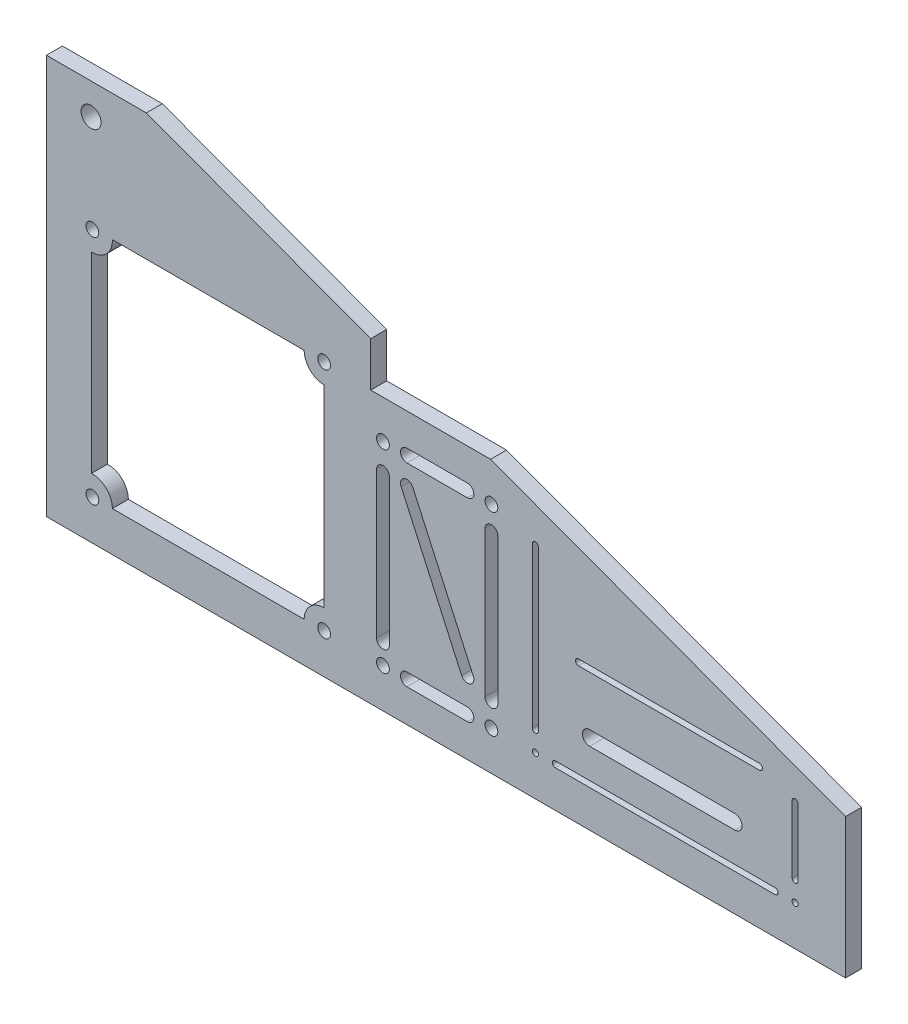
ISO-10303-21;
HEADER;
FILE_DESCRIPTION(('STEP AP214'),'2;1');
FILE_NAME('part.step','',(''),(''),'','','');
FILE_SCHEMA(('AUTOMOTIVE_DESIGN { 1 0 10303 214 1 1 1 1 }'));
ENDSEC;
DATA;
#1=APPLICATION_CONTEXT('core data for automotive mechanical design processes');
#2=APPLICATION_PROTOCOL_DEFINITION('international standard','automotive_design',2000,#1);
#3=PRODUCT_CONTEXT('',#1,'mechanical');
#4=PRODUCT('Part','Part','',(#3));
#5=PRODUCT_RELATED_PRODUCT_CATEGORY('part','',(#4));
#6=PRODUCT_DEFINITION_FORMATION('','',#4);
#7=PRODUCT_DEFINITION_CONTEXT('part definition',#1,'design');
#8=PRODUCT_DEFINITION('design','',#6,#7);
#9=PRODUCT_DEFINITION_SHAPE('','',#8);
#10=(LENGTH_UNIT() NAMED_UNIT(*) SI_UNIT(.MILLI.,.METRE.));
#11=(NAMED_UNIT(*) PLANE_ANGLE_UNIT() SI_UNIT($,.RADIAN.));
#12=(NAMED_UNIT(*) SI_UNIT($,.STERADIAN.) SOLID_ANGLE_UNIT());
#13=UNCERTAINTY_MEASURE_WITH_UNIT(LENGTH_MEASURE(1.E-05),#10,'distance_accuracy_value','');
#14=(GEOMETRIC_REPRESENTATION_CONTEXT(3) GLOBAL_UNCERTAINTY_ASSIGNED_CONTEXT((#13)) GLOBAL_UNIT_ASSIGNED_CONTEXT((#10,
#11,#12)) REPRESENTATION_CONTEXT('',''));
#15=CARTESIAN_POINT('',(0.,0.,0.));
#16=DIRECTION('',(0.,0.,1.));
#17=DIRECTION('',(1.,0.,0.));
#18=AXIS2_PLACEMENT_3D('',#15,#16,#17);
#19=CARTESIAN_POINT('',(0.,0.,4.));
#20=DIRECTION('',(0.,0.,-1.));
#21=DIRECTION('',(-1.,0.,0.));
#22=AXIS2_PLACEMENT_3D('',#19,#20,#21);
#23=PLANE('',#22);
#24=CARTESIAN_POINT('',(90.21536734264,51.5766765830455,4.));
#25=DIRECTION('',(0.,0.,1.));
#26=DIRECTION('',(1.,0.,0.));
#27=AXIS2_PLACEMENT_3D('',#24,#25,#26);
#28=CIRCLE('',#27,1.59999999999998);
#29=CARTESIAN_POINT('',(91.6722953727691,52.2380091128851,4.));
#30=VERTEX_POINT('',#29);
#31=CARTESIAN_POINT('',(88.7584393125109,50.9153440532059,4.));
#32=VERTEX_POINT('',#31);
#33=EDGE_CURVE('E432',#30,#32,#28,.T.);
#34=ORIENTED_EDGE('',*,*,#33,.F.);
#35=DIRECTION('',(-0.413332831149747,0.910580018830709,0.));
#36=VECTOR('',#35,1.);
#37=CARTESIAN_POINT('',(91.6722953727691,52.2380091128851,4.));
#38=LINE('',#37,#36);
#39=CARTESIAN_POINT('',(106.822722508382,18.8613325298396,4.));
#40=VERTEX_POINT('',#39);
#41=EDGE_CURVE('E440',#40,#30,#38,.T.);
#42=ORIENTED_EDGE('',*,*,#41,.F.);
#43=CARTESIAN_POINT('',(105.365794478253,18.2,4.));
#44=DIRECTION('',(0.,0.,1.));
#45=DIRECTION('',(1.,0.,0.));
#46=AXIS2_PLACEMENT_3D('',#43,#44,#45);
#47=CIRCLE('',#46,1.60000000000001);
#48=CARTESIAN_POINT('',(103.908866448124,17.5386674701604,4.));
#49=VERTEX_POINT('',#48);
#50=EDGE_CURVE('E437',#49,#40,#47,.T.);
#51=ORIENTED_EDGE('',*,*,#50,.F.);
#52=DIRECTION('',(0.413332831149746,-0.91058001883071,0.));
#53=VECTOR('',#52,1.);
#54=CARTESIAN_POINT('',(88.7584393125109,50.9153440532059,4.));
#55=LINE('',#54,#53);
#56=EDGE_CURVE('E434',#32,#49,#55,.T.);
#57=ORIENTED_EDGE('',*,*,#56,.F.);
#58=EDGE_LOOP('',(#34,#42,#51,#57));
#59=FACE_BOUND('',#58,.T.);
#60=CARTESIAN_POINT('',(111.365794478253,15.8312077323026,4.));
#61=DIRECTION('',(0.,0.,1.));
#62=DIRECTION('',(1.,0.,0.));
#63=AXIS2_PLACEMENT_3D('',#60,#61,#62);
#64=CIRCLE('',#63,1.6);
#65=CARTESIAN_POINT('',(109.765794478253,15.8312077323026,4.));
#66=VERTEX_POINT('',#65);
#67=CARTESIAN_POINT('',(112.965794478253,15.8312077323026,4.));
#68=VERTEX_POINT('',#67);
#69=EDGE_CURVE('E506',#66,#68,#64,.T.);
#70=ORIENTED_EDGE('',*,*,#69,.F.);
#71=DIRECTION('',(0.,-1.,0.));
#72=VECTOR('',#71,1.);
#73=CARTESIAN_POINT('',(109.765794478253,15.8312077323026,4.));
#74=LINE('',#73,#72);
#75=CARTESIAN_POINT('',(109.765794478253,52.3538112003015,4.));
#76=VERTEX_POINT('',#75);
#77=EDGE_CURVE('E514',#76,#66,#74,.T.);
#78=ORIENTED_EDGE('',*,*,#77,.F.);
#79=CARTESIAN_POINT('',(111.365794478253,52.3538112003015,4.));
#80=DIRECTION('',(0.,0.,1.));
#81=DIRECTION('',(1.,0.,0.));
#82=AXIS2_PLACEMENT_3D('',#79,#80,#81);
#83=CIRCLE('',#82,1.60000000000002);
#84=CARTESIAN_POINT('',(112.965794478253,52.3538112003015,4.));
#85=VERTEX_POINT('',#84);
#86=EDGE_CURVE('E511',#85,#76,#83,.T.);
#87=ORIENTED_EDGE('',*,*,#86,.F.);
#88=DIRECTION('',(0.,1.,0.));
#89=VECTOR('',#88,1.);
#90=CARTESIAN_POINT('',(112.965794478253,15.8312077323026,4.));
#91=LINE('',#90,#89);
#92=EDGE_CURVE('E508',#68,#85,#91,.T.);
#93=ORIENTED_EDGE('',*,*,#92,.F.);
#94=EDGE_LOOP('',(#70,#78,#87,#93));
#95=FACE_BOUND('',#94,.T.);
#96=CARTESIAN_POINT('',(84.21536734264,15.,4.));
#97=DIRECTION('',(0.,0.,1.));
#98=DIRECTION('',(1.,0.,0.));
#99=AXIS2_PLACEMENT_3D('',#96,#97,#98);
#100=CIRCLE('',#99,1.6);
#101=CARTESIAN_POINT('',(82.61536734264,15.,4.));
#102=VERTEX_POINT('',#101);
#103=CARTESIAN_POINT('',(85.81536734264,15.,4.));
#104=VERTEX_POINT('',#103);
#105=EDGE_CURVE('E574',#102,#104,#100,.T.);
#106=ORIENTED_EDGE('',*,*,#105,.F.);
#107=DIRECTION('',(0.,-1.,0.));
#108=VECTOR('',#107,1.);
#109=CARTESIAN_POINT('',(82.61536734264,15.,4.));
#110=LINE('',#109,#108);
#111=CARTESIAN_POINT('',(82.61536734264,51.5766765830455,4.));
#112=VERTEX_POINT('',#111);
#113=EDGE_CURVE('E582',#112,#102,#110,.T.);
#114=ORIENTED_EDGE('',*,*,#113,.F.);
#115=CARTESIAN_POINT('',(84.21536734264,51.5766765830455,4.));
#116=DIRECTION('',(0.,0.,1.));
#117=DIRECTION('',(1.,0.,0.));
#118=AXIS2_PLACEMENT_3D('',#115,#116,#117);
#119=CIRCLE('',#118,1.6);
#120=CARTESIAN_POINT('',(85.81536734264,51.5766765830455,4.));
#121=VERTEX_POINT('',#120);
#122=EDGE_CURVE('E579',#121,#112,#119,.T.);
#123=ORIENTED_EDGE('',*,*,#122,.F.);
#124=DIRECTION('',(0.,1.,0.));
#125=VECTOR('',#124,1.);
#126=CARTESIAN_POINT('',(85.81536734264,15.,4.));
#127=LINE('',#126,#125);
#128=EDGE_CURVE('E576',#104,#121,#127,.T.);
#129=ORIENTED_EDGE('',*,*,#128,.F.);
#130=EDGE_LOOP('',(#106,#114,#123,#129));
#131=FACE_BOUND('',#130,.T.);
#132=CARTESIAN_POINT('',(84.21536734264,9.8312077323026,4.));
#133=DIRECTION('',(0.,0.,1.));
#134=DIRECTION('',(1.,0.,0.));
#135=AXIS2_PLACEMENT_3D('',#132,#133,#134);
#136=CIRCLE('',#135,1.6);
#137=CARTESIAN_POINT('',(85.81536734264,9.8312077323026,4.));
#138=VERTEX_POINT('',#137);
#139=EDGE_CURVE('E642',#138,#138,#136,.T.);
#140=ORIENTED_EDGE('',*,*,#139,.F.);
#141=EDGE_LOOP('',(#140));
#142=FACE_BOUND('',#141,.T.);
#143=CARTESIAN_POINT('',(187.360279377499,15.,4.));
#144=DIRECTION('',(0.,0.,1.));
#145=DIRECTION('',(1.,0.,0.));
#146=AXIS2_PLACEMENT_3D('',#143,#144,#145);
#147=CIRCLE('',#146,0.749999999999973);
#148=CARTESIAN_POINT('',(186.610279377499,15.,4.));
#149=VERTEX_POINT('',#148);
#150=CARTESIAN_POINT('',(188.110279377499,15.,4.));
#151=VERTEX_POINT('',#150);
#152=EDGE_CURVE('E648',#149,#151,#147,.T.);
#153=ORIENTED_EDGE('',*,*,#152,.F.);
#154=DIRECTION('',(0.,-1.,0.));
#155=VECTOR('',#154,1.);
#156=CARTESIAN_POINT('',(186.610279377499,15.,4.));
#157=LINE('',#156,#155);
#158=CARTESIAN_POINT('',(186.610279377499,31.7786448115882,4.));
#159=VERTEX_POINT('',#158);
#160=EDGE_CURVE('E656',#159,#149,#157,.T.);
#161=ORIENTED_EDGE('',*,*,#160,.F.);
#162=CARTESIAN_POINT('',(187.360279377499,31.7786448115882,4.));
#163=DIRECTION('',(0.,0.,1.));
#164=DIRECTION('',(1.,0.,0.));
#165=AXIS2_PLACEMENT_3D('',#162,#163,#164);
#166=CIRCLE('',#165,0.750000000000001);
#167=CARTESIAN_POINT('',(188.110279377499,31.7786448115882,4.));
#168=VERTEX_POINT('',#167);
#169=EDGE_CURVE('E653',#168,#159,#166,.T.);
#170=ORIENTED_EDGE('',*,*,#169,.F.);
#171=DIRECTION('',(0.,1.,0.));
#172=VECTOR('',#171,1.);
#173=CARTESIAN_POINT('',(188.110279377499,15.,4.));
#174=LINE('',#173,#172);
#175=EDGE_CURVE('E650',#151,#168,#174,.T.);
#176=ORIENTED_EDGE('',*,*,#175,.F.);
#177=EDGE_LOOP('',(#153,#161,#170,#176));
#178=FACE_BOUND('',#177,.T.);
#179=CARTESIAN_POINT('',(187.360279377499,9.99999999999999,4.));
#180=DIRECTION('',(0.,0.,1.));
#181=DIRECTION('',(1.,0.,0.));
#182=AXIS2_PLACEMENT_3D('',#179,#180,#181);
#183=CIRCLE('',#182,0.750000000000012);
#184=CARTESIAN_POINT('',(188.110279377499,9.99999999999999,4.));
#185=VERTEX_POINT('',#184);
#186=EDGE_CURVE('E710',#185,#185,#183,.T.);
#187=ORIENTED_EDGE('',*,*,#186,.F.);
#188=EDGE_LOOP('',(#187));
#189=FACE_BOUND('',#188,.T.);
#190=CARTESIAN_POINT('',(127.360279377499,9.99999999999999,4.));
#191=DIRECTION('',(0.,0.,1.));
#192=DIRECTION('',(1.,0.,0.));
#193=AXIS2_PLACEMENT_3D('',#190,#191,#192);
#194=CIRCLE('',#193,0.750000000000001);
#195=CARTESIAN_POINT('',(127.360279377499,10.75,4.));
#196=VERTEX_POINT('',#195);
#197=CARTESIAN_POINT('',(127.360279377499,9.24999999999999,4.));
#198=VERTEX_POINT('',#197);
#199=EDGE_CURVE('E716',#196,#198,#194,.T.);
#200=ORIENTED_EDGE('',*,*,#199,.F.);
#201=DIRECTION('',(-1.,0.,0.));
#202=VECTOR('',#201,1.);
#203=CARTESIAN_POINT('',(127.360279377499,10.75,4.));
#204=LINE('',#203,#202);
#205=CARTESIAN_POINT('',(182.360279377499,10.75,4.));
#206=VERTEX_POINT('',#205);
#207=EDGE_CURVE('E724',#206,#196,#204,.T.);
#208=ORIENTED_EDGE('',*,*,#207,.F.);
#209=CARTESIAN_POINT('',(182.360279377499,9.99999999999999,4.));
#210=DIRECTION('',(0.,0.,1.));
#211=DIRECTION('',(1.,0.,0.));
#212=AXIS2_PLACEMENT_3D('',#209,#210,#211);
#213=CIRCLE('',#212,0.750000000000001);
#214=CARTESIAN_POINT('',(182.360279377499,9.24999999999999,4.));
#215=VERTEX_POINT('',#214);
#216=EDGE_CURVE('E721',#215,#206,#213,.T.);
#217=ORIENTED_EDGE('',*,*,#216,.F.);
#218=DIRECTION('',(1.,0.,0.));
#219=VECTOR('',#218,1.);
#220=CARTESIAN_POINT('',(127.360279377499,9.24999999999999,4.));
#221=LINE('',#220,#219);
#222=EDGE_CURVE('E718',#198,#215,#221,.T.);
#223=ORIENTED_EDGE('',*,*,#222,.F.);
#224=EDGE_LOOP('',(#200,#208,#217,#223));
#225=FACE_BOUND('',#224,.T.);
#226=DIRECTION('',(1.,0.,0.));
#227=VECTOR('',#226,1.);
#228=CARTESIAN_POINT('',(200.,0.,4.));
#229=LINE('',#228,#227);
#230=CARTESIAN_POINT('',(0.,0.,4.));
#231=VERTEX_POINT('',#230);
#232=CARTESIAN_POINT('',(200.,0.,4.));
#233=VERTEX_POINT('',#232);
#234=EDGE_CURVE('E836',#231,#233,#229,.T.);
#235=ORIENTED_EDGE('',*,*,#234,.T.);
#236=DIRECTION('',(0.,1.,0.));
#237=VECTOR('',#236,1.);
#238=CARTESIAN_POINT('',(200.,35.,4.));
#239=LINE('',#238,#237);
#240=CARTESIAN_POINT('',(200.,35.,4.));
#241=VERTEX_POINT('',#240);
#242=EDGE_CURVE('E839',#233,#241,#239,.T.);
#243=ORIENTED_EDGE('',*,*,#242,.T.);
#244=DIRECTION('',(-0.937425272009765,0.348186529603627,0.));
#245=VECTOR('',#244,1.);
#246=CARTESIAN_POINT('',(111.153846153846,68.,4.));
#247=LINE('',#246,#245);
#248=CARTESIAN_POINT('',(111.153846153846,68.,4.));
#249=VERTEX_POINT('',#248);
#250=EDGE_CURVE('E842',#241,#249,#247,.T.);
#251=ORIENTED_EDGE('',*,*,#250,.T.);
#252=DIRECTION('',(-1.,0.,0.));
#253=VECTOR('',#252,1.);
#254=CARTESIAN_POINT('',(111.153846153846,68.,4.));
#255=LINE('',#254,#253);
#256=CARTESIAN_POINT('',(81.1538461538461,68.,4.));
#257=VERTEX_POINT('',#256);
#258=EDGE_CURVE('E844',#249,#257,#255,.T.);
#259=ORIENTED_EDGE('',*,*,#258,.T.);
#260=DIRECTION('',(0.,1.,0.));
#261=VECTOR('',#260,1.);
#262=CARTESIAN_POINT('',(81.1538461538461,68.,4.));
#263=LINE('',#262,#261);
#264=CARTESIAN_POINT('',(81.1538461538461,79.1428571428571,4.));
#265=VERTEX_POINT('',#264);
#266=EDGE_CURVE('E846',#257,#265,#263,.T.);
#267=ORIENTED_EDGE('',*,*,#266,.T.);
#268=DIRECTION('',(-0.937425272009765,0.348186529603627,0.));
#269=VECTOR('',#268,1.);
#270=CARTESIAN_POINT('',(25.,100.,4.));
#271=LINE('',#270,#269);
#272=CARTESIAN_POINT('',(25.,100.,4.));
#273=VERTEX_POINT('',#272);
#274=EDGE_CURVE('E848',#265,#273,#271,.T.);
#275=ORIENTED_EDGE('',*,*,#274,.T.);
#276=DIRECTION('',(-1.,0.,0.));
#277=VECTOR('',#276,1.);
#278=CARTESIAN_POINT('',(0.,100.,4.));
#279=LINE('',#278,#277);
#280=CARTESIAN_POINT('',(0.,100.,4.));
#281=VERTEX_POINT('',#280);
#282=EDGE_CURVE('E850',#273,#281,#279,.T.);
#283=ORIENTED_EDGE('',*,*,#282,.T.);
#284=DIRECTION('',(0.,-1.,0.));
#285=VECTOR('',#284,1.);
#286=CARTESIAN_POINT('',(0.,73.4827220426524,4.));
#287=LINE('',#286,#285);
#288=EDGE_CURVE('E852',#281,#231,#287,.T.);
#289=ORIENTED_EDGE('',*,*,#288,.T.);
#290=EDGE_LOOP('',(#235,#243,#251,#259,#267,#275,#283,#289));
#291=FACE_BOUND('',#290,.T.);
#292=CARTESIAN_POINT('',(11.5,68.,4.));
#293=DIRECTION('',(0.,0.,-1.));
#294=DIRECTION('',(-1.,0.,0.));
#295=AXIS2_PLACEMENT_3D('',#292,#293,#294);
#296=CIRCLE('',#295,5.);
#297=CARTESIAN_POINT('',(16.4915839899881,68.2899815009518,4.));
#298=VERTEX_POINT('',#297);
#299=CARTESIAN_POINT('',(11.2434224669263,63.0065875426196,4.));
#300=VERTEX_POINT('',#299);
#301=EDGE_CURVE('E777',#298,#300,#296,.T.);
#302=ORIENTED_EDGE('',*,*,#301,.F.);
#303=DIRECTION('',(-1.,0.,0.));
#304=VECTOR('',#303,1.);
#305=CARTESIAN_POINT('',(16.4915839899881,68.2899815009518,4.));
#306=LINE('',#305,#304);
#307=CARTESIAN_POINT('',(64.5,68.2899815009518,4.));
#308=VERTEX_POINT('',#307);
#309=EDGE_CURVE('E793',#308,#298,#306,.T.);
#310=ORIENTED_EDGE('',*,*,#309,.F.);
#311=CARTESIAN_POINT('',(69.5,68.2899815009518,4.));
#312=DIRECTION('',(0.,0.,-1.));
#313=DIRECTION('',(-1.,0.,0.));
#314=AXIS2_PLACEMENT_3D('',#311,#312,#313);
#315=CIRCLE('',#314,5.);
#316=CARTESIAN_POINT('',(69.5,63.2899815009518,4.));
#317=VERTEX_POINT('',#316);
#318=EDGE_CURVE('E790',#317,#308,#315,.T.);
#319=ORIENTED_EDGE('',*,*,#318,.F.);
#320=DIRECTION('',(0.,1.,0.));
#321=VECTOR('',#320,1.);
#322=CARTESIAN_POINT('',(69.5,15.,4.));
#323=LINE('',#322,#321);
#324=CARTESIAN_POINT('',(69.5,15.,4.));
#325=VERTEX_POINT('',#324);
#326=EDGE_CURVE('E788',#325,#317,#323,.T.);
#327=ORIENTED_EDGE('',*,*,#326,.F.);
#328=CARTESIAN_POINT('',(69.5,9.99999999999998,4.));
#329=DIRECTION('',(0.,0.,-1.));
#330=DIRECTION('',(-1.,0.,0.));
#331=AXIS2_PLACEMENT_3D('',#328,#329,#330);
#332=CIRCLE('',#331,5.);
#333=CARTESIAN_POINT('',(64.5,9.99999999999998,4.));
#334=VERTEX_POINT('',#333);
#335=EDGE_CURVE('E786',#334,#325,#332,.T.);
#336=ORIENTED_EDGE('',*,*,#335,.F.);
#337=DIRECTION('',(1.,0.,0.));
#338=VECTOR('',#337,1.);
#339=CARTESIAN_POINT('',(16.5,9.99999999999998,4.));
#340=LINE('',#339,#338);
#341=CARTESIAN_POINT('',(16.5,9.99999999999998,4.));
#342=VERTEX_POINT('',#341);
#343=EDGE_CURVE('E784',#342,#334,#340,.T.);
#344=ORIENTED_EDGE('',*,*,#343,.F.);
#345=CARTESIAN_POINT('',(11.5,9.99999999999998,4.));
#346=DIRECTION('',(0.,0.,-1.));
#347=DIRECTION('',(1.,0.,0.));
#348=AXIS2_PLACEMENT_3D('',#345,#346,#347);
#349=CIRCLE('',#348,5.);
#350=CARTESIAN_POINT('',(11.2434224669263,14.9934124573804,4.));
#351=VERTEX_POINT('',#350);
#352=EDGE_CURVE('E782',#351,#342,#349,.T.);
#353=ORIENTED_EDGE('',*,*,#352,.F.);
#354=DIRECTION('',(0.,-1.,0.));
#355=VECTOR('',#354,1.);
#356=CARTESIAN_POINT('',(11.2434224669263,14.9934124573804,4.));
#357=LINE('',#356,#355);
#358=EDGE_CURVE('E779',#300,#351,#357,.T.);
#359=ORIENTED_EDGE('',*,*,#358,.F.);
#360=EDGE_LOOP('',(#302,#310,#319,#327,#336,#344,#353,#359));
#361=FACE_BOUND('',#360,.T.);
#362=CARTESIAN_POINT('',(11.5,68.,4.));
#363=DIRECTION('',(0.,0.,1.));
#364=DIRECTION('',(1.,0.,0.));
#365=AXIS2_PLACEMENT_3D('',#362,#363,#364);
#366=CIRCLE('',#365,1.6);
#367=CARTESIAN_POINT('',(13.1,68.,4.));
#368=VERTEX_POINT('',#367);
#369=EDGE_CURVE('E771',#368,#368,#366,.T.);
#370=ORIENTED_EDGE('',*,*,#369,.F.);
#371=EDGE_LOOP('',(#370));
#372=FACE_BOUND('',#371,.T.);
#373=CARTESIAN_POINT('',(69.5,68.2899815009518,4.));
#374=DIRECTION('',(0.,0.,1.));
#375=DIRECTION('',(1.,0.,0.));
#376=AXIS2_PLACEMENT_3D('',#373,#374,#375);
#377=CIRCLE('',#376,1.60000000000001);
#378=CARTESIAN_POINT('',(71.1,68.2899815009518,4.));
#379=VERTEX_POINT('',#378);
#380=EDGE_CURVE('E765',#379,#379,#377,.T.);
#381=ORIENTED_EDGE('',*,*,#380,.F.);
#382=EDGE_LOOP('',(#381));
#383=FACE_BOUND('',#382,.T.);
#384=CARTESIAN_POINT('',(69.5,9.99999999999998,4.));
#385=DIRECTION('',(0.,0.,1.));
#386=DIRECTION('',(1.,0.,0.));
#387=AXIS2_PLACEMENT_3D('',#384,#385,#386);
#388=CIRCLE('',#387,1.6);
#389=CARTESIAN_POINT('',(71.1,9.99999999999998,4.));
#390=VERTEX_POINT('',#389);
#391=EDGE_CURVE('E759',#390,#390,#388,.T.);
#392=ORIENTED_EDGE('',*,*,#391,.F.);
#393=EDGE_LOOP('',(#392));
#394=FACE_BOUND('',#393,.T.);
#395=CARTESIAN_POINT('',(11.5,9.99999999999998,4.));
#396=DIRECTION('',(0.,0.,1.));
#397=DIRECTION('',(1.,0.,0.));
#398=AXIS2_PLACEMENT_3D('',#395,#396,#397);
#399=CIRCLE('',#398,1.6);
#400=CARTESIAN_POINT('',(13.1,9.99999999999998,4.));
#401=VERTEX_POINT('',#400);
#402=EDGE_CURVE('E753',#401,#401,#399,.T.);
#403=ORIENTED_EDGE('',*,*,#402,.F.);
#404=EDGE_LOOP('',(#403));
#405=FACE_BOUND('',#404,.T.);
#406=CARTESIAN_POINT('',(122.360279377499,9.99999999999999,4.));
#407=DIRECTION('',(0.,0.,1.));
#408=DIRECTION('',(1.,0.,0.));
#409=AXIS2_PLACEMENT_3D('',#406,#407,#408);
#410=CIRCLE('',#409,0.749999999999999);
#411=CARTESIAN_POINT('',(123.110279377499,9.99999999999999,4.));
#412=VERTEX_POINT('',#411);
#413=EDGE_CURVE('E747',#412,#412,#410,.T.);
#414=ORIENTED_EDGE('',*,*,#413,.F.);
#415=EDGE_LOOP('',(#414));
#416=FACE_BOUND('',#415,.T.);
#417=CARTESIAN_POINT('',(122.360279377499,15.,4.));
#418=DIRECTION('',(0.,0.,1.));
#419=DIRECTION('',(1.,0.,0.));
#420=AXIS2_PLACEMENT_3D('',#417,#418,#419);
#421=CIRCLE('',#420,0.749999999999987);
#422=CARTESIAN_POINT('',(121.610279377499,15.,4.));
#423=VERTEX_POINT('',#422);
#424=CARTESIAN_POINT('',(123.110279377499,15.,4.));
#425=VERTEX_POINT('',#424);
#426=EDGE_CURVE('E679',#423,#425,#421,.T.);
#427=ORIENTED_EDGE('',*,*,#426,.F.);
#428=DIRECTION('',(0.,-1.,0.));
#429=VECTOR('',#428,1.);
#430=CARTESIAN_POINT('',(121.610279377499,15.,4.));
#431=LINE('',#430,#429);
#432=CARTESIAN_POINT('',(121.610279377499,55.,4.));
#433=VERTEX_POINT('',#432);
#434=EDGE_CURVE('E687',#433,#423,#431,.T.);
#435=ORIENTED_EDGE('',*,*,#434,.F.);
#436=CARTESIAN_POINT('',(122.360279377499,55.,4.));
#437=DIRECTION('',(0.,0.,1.));
#438=DIRECTION('',(1.,0.,0.));
#439=AXIS2_PLACEMENT_3D('',#436,#437,#438);
#440=CIRCLE('',#439,0.750000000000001);
#441=CARTESIAN_POINT('',(123.110279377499,55.,4.));
#442=VERTEX_POINT('',#441);
#443=EDGE_CURVE('E684',#442,#433,#440,.T.);
#444=ORIENTED_EDGE('',*,*,#443,.F.);
#445=DIRECTION('',(0.,1.,0.));
#446=VECTOR('',#445,1.);
#447=CARTESIAN_POINT('',(123.110279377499,15.,4.));
#448=LINE('',#447,#446);
#449=EDGE_CURVE('E681',#425,#442,#448,.T.);
#450=ORIENTED_EDGE('',*,*,#449,.F.);
#451=EDGE_LOOP('',(#427,#435,#444,#450));
#452=FACE_BOUND('',#451,.T.);
#453=CARTESIAN_POINT('',(90.21536734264,9.8312077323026,4.));
#454=DIRECTION('',(0.,0.,1.));
#455=DIRECTION('',(1.,0.,0.));
#456=AXIS2_PLACEMENT_3D('',#453,#454,#455);
#457=CIRCLE('',#456,1.6);
#458=CARTESIAN_POINT('',(90.21536734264,11.4312077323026,4.));
#459=VERTEX_POINT('',#458);
#460=CARTESIAN_POINT('',(90.21536734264,8.2312077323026,4.));
#461=VERTEX_POINT('',#460);
#462=EDGE_CURVE('E611',#459,#461,#457,.T.);
#463=ORIENTED_EDGE('',*,*,#462,.F.);
#464=DIRECTION('',(-1.,0.,0.));
#465=VECTOR('',#464,1.);
#466=CARTESIAN_POINT('',(90.21536734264,11.4312077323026,4.));
#467=LINE('',#466,#465);
#468=CARTESIAN_POINT('',(105.365794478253,11.4312077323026,4.));
#469=VERTEX_POINT('',#468);
#470=EDGE_CURVE('E619',#469,#459,#467,.T.);
#471=ORIENTED_EDGE('',*,*,#470,.F.);
#472=CARTESIAN_POINT('',(105.365794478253,9.8312077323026,4.));
#473=DIRECTION('',(0.,0.,1.));
#474=DIRECTION('',(1.,0.,0.));
#475=AXIS2_PLACEMENT_3D('',#472,#473,#474);
#476=CIRCLE('',#475,1.6);
#477=CARTESIAN_POINT('',(105.365794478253,8.2312077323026,4.));
#478=VERTEX_POINT('',#477);
#479=EDGE_CURVE('E616',#478,#469,#476,.T.);
#480=ORIENTED_EDGE('',*,*,#479,.F.);
#481=DIRECTION('',(1.,0.,0.));
#482=VECTOR('',#481,1.);
#483=CARTESIAN_POINT('',(90.21536734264,8.2312077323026,4.));
#484=LINE('',#483,#482);
#485=EDGE_CURVE('E613',#461,#478,#484,.T.);
#486=ORIENTED_EDGE('',*,*,#485,.F.);
#487=EDGE_LOOP('',(#463,#471,#480,#486));
#488=FACE_BOUND('',#487,.T.);
#489=CARTESIAN_POINT('',(111.365794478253,9.8312077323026,4.));
#490=DIRECTION('',(0.,0.,1.));
#491=DIRECTION('',(1.,0.,0.));
#492=AXIS2_PLACEMENT_3D('',#489,#490,#491);
#493=CIRCLE('',#492,1.6);
#494=CARTESIAN_POINT('',(112.965794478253,9.8312077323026,4.));
#495=VERTEX_POINT('',#494);
#496=EDGE_CURVE('E605',#495,#495,#493,.T.);
#497=ORIENTED_EDGE('',*,*,#496,.F.);
#498=EDGE_LOOP('',(#497));
#499=FACE_BOUND('',#498,.T.);
#500=CARTESIAN_POINT('',(135.938255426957,20.,4.));
#501=DIRECTION('',(0.,0.,1.));
#502=DIRECTION('',(1.,0.,0.));
#503=AXIS2_PLACEMENT_3D('',#500,#501,#502);
#504=CIRCLE('',#503,1.8);
#505=CARTESIAN_POINT('',(135.938255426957,21.8,4.));
#506=VERTEX_POINT('',#505);
#507=CARTESIAN_POINT('',(135.938255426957,18.2,4.));
#508=VERTEX_POINT('',#507);
#509=EDGE_CURVE('E543',#506,#508,#504,.T.);
#510=ORIENTED_EDGE('',*,*,#509,.F.);
#511=DIRECTION('',(-1.,0.,0.));
#512=VECTOR('',#511,1.);
#513=CARTESIAN_POINT('',(135.938255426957,21.8,4.));
#514=LINE('',#513,#512);
#515=CARTESIAN_POINT('',(172.28001568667,21.8,4.));
#516=VERTEX_POINT('',#515);
#517=EDGE_CURVE('E551',#516,#506,#514,.T.);
#518=ORIENTED_EDGE('',*,*,#517,.F.);
#519=CARTESIAN_POINT('',(172.28001568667,20.,4.));
#520=DIRECTION('',(0.,0.,1.));
#521=DIRECTION('',(1.,0.,0.));
#522=AXIS2_PLACEMENT_3D('',#519,#520,#521);
#523=CIRCLE('',#522,1.8);
#524=CARTESIAN_POINT('',(172.28001568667,18.2,4.));
#525=VERTEX_POINT('',#524);
#526=EDGE_CURVE('E548',#525,#516,#523,.T.);
#527=ORIENTED_EDGE('',*,*,#526,.F.);
#528=DIRECTION('',(1.,0.,0.));
#529=VECTOR('',#528,1.);
#530=CARTESIAN_POINT('',(135.938255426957,18.2,4.));
#531=LINE('',#530,#529);
#532=EDGE_CURVE('E545',#508,#525,#531,.T.);
#533=ORIENTED_EDGE('',*,*,#532,.F.);
#534=EDGE_LOOP('',(#510,#518,#527,#533));
#535=FACE_BOUND('',#534,.T.);
#536=CARTESIAN_POINT('',(11.1666747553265,92.2208327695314,4.));
#537=DIRECTION('',(0.,0.,1.));
#538=DIRECTION('',(1.,0.,0.));
#539=AXIS2_PLACEMENT_3D('',#536,#537,#538);
#540=CIRCLE('',#539,2.5);
#541=CARTESIAN_POINT('',(13.6666747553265,92.2208327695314,4.));
#542=VERTEX_POINT('',#541);
#543=EDGE_CURVE('E537',#542,#542,#540,.T.);
#544=ORIENTED_EDGE('',*,*,#543,.F.);
#545=EDGE_LOOP('',(#544));
#546=FACE_BOUND('',#545,.T.);
#547=CARTESIAN_POINT('',(105.365794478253,58.3538112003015,4.));
#548=DIRECTION('',(0.,0.,1.));
#549=DIRECTION('',(1.,0.,0.));
#550=AXIS2_PLACEMENT_3D('',#547,#548,#549);
#551=CIRCLE('',#550,1.6);
#552=CARTESIAN_POINT('',(105.365794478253,56.7538112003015,4.));
#553=VERTEX_POINT('',#552);
#554=CARTESIAN_POINT('',(105.365794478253,59.9538112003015,4.));
#555=VERTEX_POINT('',#554);
#556=EDGE_CURVE('E475',#553,#555,#551,.T.);
#557=ORIENTED_EDGE('',*,*,#556,.F.);
#558=DIRECTION('',(1.,0.,0.));
#559=VECTOR('',#558,1.);
#560=CARTESIAN_POINT('',(105.365794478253,56.7538112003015,4.));
#561=LINE('',#560,#559);
#562=CARTESIAN_POINT('',(90.21536734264,56.7538112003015,4.));
#563=VERTEX_POINT('',#562);
#564=EDGE_CURVE('E483',#563,#553,#561,.T.);
#565=ORIENTED_EDGE('',*,*,#564,.F.);
#566=CARTESIAN_POINT('',(90.21536734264,58.3538112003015,4.));
#567=DIRECTION('',(0.,0.,1.));
#568=DIRECTION('',(1.,0.,0.));
#569=AXIS2_PLACEMENT_3D('',#566,#567,#568);
#570=CIRCLE('',#569,1.6);
#571=CARTESIAN_POINT('',(90.21536734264,59.9538112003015,4.));
#572=VERTEX_POINT('',#571);
#573=EDGE_CURVE('E480',#572,#563,#570,.T.);
#574=ORIENTED_EDGE('',*,*,#573,.F.);
#575=DIRECTION('',(-1.,0.,0.));
#576=VECTOR('',#575,1.);
#577=CARTESIAN_POINT('',(105.365794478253,59.9538112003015,4.));
#578=LINE('',#577,#576);
#579=EDGE_CURVE('E477',#555,#572,#578,.T.);
#580=ORIENTED_EDGE('',*,*,#579,.F.);
#581=EDGE_LOOP('',(#557,#565,#574,#580));
#582=FACE_BOUND('',#581,.T.);
#583=CARTESIAN_POINT('',(84.21536734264,58.3538112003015,4.));
#584=DIRECTION('',(0.,0.,1.));
#585=DIRECTION('',(1.,0.,0.));
#586=AXIS2_PLACEMENT_3D('',#583,#584,#585);
#587=CIRCLE('',#586,1.60000000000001);
#588=CARTESIAN_POINT('',(85.81536734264,58.3538112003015,4.));
#589=VERTEX_POINT('',#588);
#590=EDGE_CURVE('E469',#589,#589,#587,.T.);
#591=ORIENTED_EDGE('',*,*,#590,.F.);
#592=EDGE_LOOP('',(#591));
#593=FACE_BOUND('',#592,.T.);
#594=CARTESIAN_POINT('',(111.365794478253,58.3538112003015,4.));
#595=DIRECTION('',(0.,0.,1.));
#596=DIRECTION('',(1.,0.,0.));
#597=AXIS2_PLACEMENT_3D('',#594,#595,#596);
#598=CIRCLE('',#597,1.60000000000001);
#599=CARTESIAN_POINT('',(112.965794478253,58.3538112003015,4.));
#600=VERTEX_POINT('',#599);
#601=EDGE_CURVE('E463',#600,#600,#598,.T.);
#602=ORIENTED_EDGE('',*,*,#601,.F.);
#603=EDGE_LOOP('',(#602));
#604=FACE_BOUND('',#603,.T.);
#605=CARTESIAN_POINT('',(133.149235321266,35.,4.));
#606=DIRECTION('',(0.,0.,1.));
#607=DIRECTION('',(1.,0.,0.));
#608=AXIS2_PLACEMENT_3D('',#605,#606,#607);
#609=CIRCLE('',#608,0.750000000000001);
#610=CARTESIAN_POINT('',(133.149235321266,35.75,4.));
#611=VERTEX_POINT('',#610);
#612=CARTESIAN_POINT('',(133.149235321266,34.25,4.));
#613=VERTEX_POINT('',#612);
#614=EDGE_CURVE('E396',#611,#613,#609,.T.);
#615=ORIENTED_EDGE('',*,*,#614,.F.);
#616=DIRECTION('',(-1.,0.,0.));
#617=VECTOR('',#616,1.);
#618=CARTESIAN_POINT('',(133.149235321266,35.75,4.));
#619=LINE('',#618,#617);
#620=CARTESIAN_POINT('',(178.445613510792,35.75,4.));
#621=VERTEX_POINT('',#620);
#622=EDGE_CURVE('E418',#621,#611,#619,.T.);
#623=ORIENTED_EDGE('',*,*,#622,.F.);
#624=CARTESIAN_POINT('',(178.445613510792,35.,4.));
#625=DIRECTION('',(0.,0.,1.));
#626=DIRECTION('',(1.,0.,0.));
#627=AXIS2_PLACEMENT_3D('',#624,#625,#626);
#628=CIRCLE('',#627,0.750000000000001);
#629=CARTESIAN_POINT('',(178.445613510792,34.25,4.));
#630=VERTEX_POINT('',#629);
#631=EDGE_CURVE('E416',#630,#621,#628,.T.);
#632=ORIENTED_EDGE('',*,*,#631,.F.);
#633=DIRECTION('',(1.,0.,0.));
#634=VECTOR('',#633,1.);
#635=CARTESIAN_POINT('',(133.149235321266,34.25,4.));
#636=LINE('',#635,#634);
#637=EDGE_CURVE('E404',#613,#630,#636,.T.);
#638=ORIENTED_EDGE('',*,*,#637,.F.);
#639=EDGE_LOOP('',(#615,#623,#632,#638));
#640=FACE_BOUND('',#639,.T.);
#641=ADVANCED_FACE('F43',(#59,#95,#131,#142,#178,#189,#225,#291,#361,#372,#383,#394,#405,#416,
#452,#488,#499,#535,#546,#582,#593,#604,#640),#23,.F.);
#642=CARTESIAN_POINT('',(0.,0.,0.));
#643=DIRECTION('',(0.,0.,-1.));
#644=DIRECTION('',(-1.,0.,0.));
#645=AXIS2_PLACEMENT_3D('',#642,#643,#644);
#646=PLANE('',#645);
#647=CARTESIAN_POINT('',(84.21536734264,58.3538112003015,0.));
#648=DIRECTION('',(0.,0.,1.));
#649=DIRECTION('',(1.,0.,0.));
#650=AXIS2_PLACEMENT_3D('',#647,#648,#649);
#651=CIRCLE('',#650,1.60000000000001);
#652=CARTESIAN_POINT('',(85.81536734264,58.3538112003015,0.));
#653=VERTEX_POINT('',#652);
#654=EDGE_CURVE('E466',#653,#653,#651,.T.);
#655=ORIENTED_EDGE('',*,*,#654,.T.);
#656=EDGE_LOOP('',(#655));
#657=FACE_BOUND('',#656,.T.);
#658=DIRECTION('',(-1.,0.,0.));
#659=VECTOR('',#658,1.);
#660=CARTESIAN_POINT('',(135.938255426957,21.8,0.));
#661=LINE('',#660,#659);
#662=CARTESIAN_POINT('',(172.28001568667,21.8,0.));
#663=VERTEX_POINT('',#662);
#664=CARTESIAN_POINT('',(135.938255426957,21.8,0.));
#665=VERTEX_POINT('',#664);
#666=EDGE_CURVE('E546',#663,#665,#661,.T.);
#667=ORIENTED_EDGE('',*,*,#666,.T.);
#668=CARTESIAN_POINT('',(135.938255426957,20.,0.));
#669=DIRECTION('',(0.,0.,1.));
#670=DIRECTION('',(1.,0.,0.));
#671=AXIS2_PLACEMENT_3D('',#668,#669,#670);
#672=CIRCLE('',#671,1.8);
#673=CARTESIAN_POINT('',(135.938255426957,18.2,0.));
#674=VERTEX_POINT('',#673);
#675=EDGE_CURVE('E540',#665,#674,#672,.T.);
#676=ORIENTED_EDGE('',*,*,#675,.T.);
#677=DIRECTION('',(1.,0.,0.));
#678=VECTOR('',#677,1.);
#679=CARTESIAN_POINT('',(135.938255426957,18.2,0.));
#680=LINE('',#679,#678);
#681=CARTESIAN_POINT('',(172.28001568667,18.2,0.));
#682=VERTEX_POINT('',#681);
#683=EDGE_CURVE('E556',#674,#682,#680,.T.);
#684=ORIENTED_EDGE('',*,*,#683,.T.);
#685=CARTESIAN_POINT('',(172.28001568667,20.,0.));
#686=DIRECTION('',(0.,0.,1.));
#687=DIRECTION('',(1.,0.,0.));
#688=AXIS2_PLACEMENT_3D('',#685,#686,#687);
#689=CIRCLE('',#688,1.8);
#690=EDGE_CURVE('E559',#682,#663,#689,.T.);
#691=ORIENTED_EDGE('',*,*,#690,.T.);
#692=EDGE_LOOP('',(#667,#676,#684,#691));
#693=FACE_BOUND('',#692,.T.);
#694=DIRECTION('',(0.,-1.,0.));
#695=VECTOR('',#694,1.);
#696=CARTESIAN_POINT('',(82.61536734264,15.,0.));
#697=LINE('',#696,#695);
#698=CARTESIAN_POINT('',(82.61536734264,51.5766765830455,0.));
#699=VERTEX_POINT('',#698);
#700=CARTESIAN_POINT('',(82.61536734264,15.,0.));
#701=VERTEX_POINT('',#700);
#702=EDGE_CURVE('E577',#699,#701,#697,.T.);
#703=ORIENTED_EDGE('',*,*,#702,.T.);
#704=CARTESIAN_POINT('',(84.21536734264,15.,0.));
#705=DIRECTION('',(0.,0.,1.));
#706=DIRECTION('',(1.,0.,0.));
#707=AXIS2_PLACEMENT_3D('',#704,#705,#706);
#708=CIRCLE('',#707,1.6);
#709=CARTESIAN_POINT('',(85.81536734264,15.,0.));
#710=VERTEX_POINT('',#709);
#711=EDGE_CURVE('E573',#701,#710,#708,.T.);
#712=ORIENTED_EDGE('',*,*,#711,.T.);
#713=DIRECTION('',(0.,1.,0.));
#714=VECTOR('',#713,1.);
#715=CARTESIAN_POINT('',(85.81536734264,15.,0.));
#716=LINE('',#715,#714);
#717=CARTESIAN_POINT('',(85.81536734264,51.5766765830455,0.));
#718=VERTEX_POINT('',#717);
#719=EDGE_CURVE('E587',#710,#718,#716,.T.);
#720=ORIENTED_EDGE('',*,*,#719,.T.);
#721=CARTESIAN_POINT('',(84.21536734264,51.5766765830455,0.));
#722=DIRECTION('',(0.,0.,1.));
#723=DIRECTION('',(1.,0.,0.));
#724=AXIS2_PLACEMENT_3D('',#721,#722,#723);
#725=CIRCLE('',#724,1.6);
#726=EDGE_CURVE('E590',#718,#699,#725,.T.);
#727=ORIENTED_EDGE('',*,*,#726,.T.);
#728=EDGE_LOOP('',(#703,#712,#720,#727));
#729=FACE_BOUND('',#728,.T.);
#730=CARTESIAN_POINT('',(111.365794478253,9.8312077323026,0.));
#731=DIRECTION('',(0.,0.,1.));
#732=DIRECTION('',(1.,0.,0.));
#733=AXIS2_PLACEMENT_3D('',#730,#731,#732);
#734=CIRCLE('',#733,1.6);
#735=CARTESIAN_POINT('',(112.965794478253,9.8312077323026,0.));
#736=VERTEX_POINT('',#735);
#737=EDGE_CURVE('E604',#736,#736,#734,.T.);
#738=ORIENTED_EDGE('',*,*,#737,.T.);
#739=EDGE_LOOP('',(#738));
#740=FACE_BOUND('',#739,.T.);
#741=DIRECTION('',(0.,-1.,0.));
#742=VECTOR('',#741,1.);
#743=CARTESIAN_POINT('',(186.610279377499,15.,0.));
#744=LINE('',#743,#742);
#745=CARTESIAN_POINT('',(186.610279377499,31.7786448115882,0.));
#746=VERTEX_POINT('',#745);
#747=CARTESIAN_POINT('',(186.610279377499,15.,0.));
#748=VERTEX_POINT('',#747);
#749=EDGE_CURVE('E651',#746,#748,#744,.T.);
#750=ORIENTED_EDGE('',*,*,#749,.T.);
#751=CARTESIAN_POINT('',(187.360279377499,15.,0.));
#752=DIRECTION('',(0.,0.,1.));
#753=DIRECTION('',(1.,0.,0.));
#754=AXIS2_PLACEMENT_3D('',#751,#752,#753);
#755=CIRCLE('',#754,0.749999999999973);
#756=CARTESIAN_POINT('',(188.110279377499,15.,0.));
#757=VERTEX_POINT('',#756);
#758=EDGE_CURVE('E645',#748,#757,#755,.T.);
#759=ORIENTED_EDGE('',*,*,#758,.T.);
#760=DIRECTION('',(0.,1.,0.));
#761=VECTOR('',#760,1.);
#762=CARTESIAN_POINT('',(188.110279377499,15.,0.));
#763=LINE('',#762,#761);
#764=CARTESIAN_POINT('',(188.110279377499,31.7786448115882,0.));
#765=VERTEX_POINT('',#764);
#766=EDGE_CURVE('E661',#757,#765,#763,.T.);
#767=ORIENTED_EDGE('',*,*,#766,.T.);
#768=CARTESIAN_POINT('',(187.360279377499,31.7786448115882,0.));
#769=DIRECTION('',(0.,0.,1.));
#770=DIRECTION('',(1.,0.,0.));
#771=AXIS2_PLACEMENT_3D('',#768,#769,#770);
#772=CIRCLE('',#771,0.750000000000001);
#773=EDGE_CURVE('E664',#765,#746,#772,.T.);
#774=ORIENTED_EDGE('',*,*,#773,.T.);
#775=EDGE_LOOP('',(#750,#759,#767,#774));
#776=FACE_BOUND('',#775,.T.);
#777=DIRECTION('',(0.,-1.,0.));
#778=VECTOR('',#777,1.);
#779=CARTESIAN_POINT('',(121.610279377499,15.,0.));
#780=LINE('',#779,#778);
#781=CARTESIAN_POINT('',(121.610279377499,55.,0.));
#782=VERTEX_POINT('',#781);
#783=CARTESIAN_POINT('',(121.610279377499,15.,0.));
#784=VERTEX_POINT('',#783);
#785=EDGE_CURVE('E682',#782,#784,#780,.T.);
#786=ORIENTED_EDGE('',*,*,#785,.T.);
#787=CARTESIAN_POINT('',(122.360279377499,15.,0.));
#788=DIRECTION('',(0.,0.,1.));
#789=DIRECTION('',(1.,0.,0.));
#790=AXIS2_PLACEMENT_3D('',#787,#788,#789);
#791=CIRCLE('',#790,0.749999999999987);
#792=CARTESIAN_POINT('',(123.110279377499,15.,0.));
#793=VERTEX_POINT('',#792);
#794=EDGE_CURVE('E678',#784,#793,#791,.T.);
#795=ORIENTED_EDGE('',*,*,#794,.T.);
#796=DIRECTION('',(0.,1.,0.));
#797=VECTOR('',#796,1.);
#798=CARTESIAN_POINT('',(123.110279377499,15.,0.));
#799=LINE('',#798,#797);
#800=CARTESIAN_POINT('',(123.110279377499,55.,0.));
#801=VERTEX_POINT('',#800);
#802=EDGE_CURVE('E692',#793,#801,#799,.T.);
#803=ORIENTED_EDGE('',*,*,#802,.T.);
#804=CARTESIAN_POINT('',(122.360279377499,55.,0.));
#805=DIRECTION('',(0.,0.,1.));
#806=DIRECTION('',(1.,0.,0.));
#807=AXIS2_PLACEMENT_3D('',#804,#805,#806);
#808=CIRCLE('',#807,0.750000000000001);
#809=EDGE_CURVE('E695',#801,#782,#808,.T.);
#810=ORIENTED_EDGE('',*,*,#809,.T.);
#811=EDGE_LOOP('',(#786,#795,#803,#810));
#812=FACE_BOUND('',#811,.T.);
#813=CARTESIAN_POINT('',(187.360279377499,9.99999999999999,0.));
#814=DIRECTION('',(0.,0.,1.));
#815=DIRECTION('',(1.,0.,0.));
#816=AXIS2_PLACEMENT_3D('',#813,#814,#815);
#817=CIRCLE('',#816,0.750000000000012);
#818=CARTESIAN_POINT('',(188.110279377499,9.99999999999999,0.));
#819=VERTEX_POINT('',#818);
#820=EDGE_CURVE('E709',#819,#819,#817,.T.);
#821=ORIENTED_EDGE('',*,*,#820,.T.);
#822=EDGE_LOOP('',(#821));
#823=FACE_BOUND('',#822,.T.);
#824=CARTESIAN_POINT('',(11.5,9.99999999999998,0.));
#825=DIRECTION('',(0.,0.,1.));
#826=DIRECTION('',(1.,0.,0.));
#827=AXIS2_PLACEMENT_3D('',#824,#825,#826);
#828=CIRCLE('',#827,1.6);
#829=CARTESIAN_POINT('',(13.1,9.99999999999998,0.));
#830=VERTEX_POINT('',#829);
#831=EDGE_CURVE('E750',#830,#830,#828,.T.);
#832=ORIENTED_EDGE('',*,*,#831,.T.);
#833=EDGE_LOOP('',(#832));
#834=FACE_BOUND('',#833,.T.);
#835=CARTESIAN_POINT('',(69.5,68.2899815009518,0.));
#836=DIRECTION('',(0.,0.,1.));
#837=DIRECTION('',(1.,0.,0.));
#838=AXIS2_PLACEMENT_3D('',#835,#836,#837);
#839=CIRCLE('',#838,1.60000000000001);
#840=CARTESIAN_POINT('',(71.1,68.2899815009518,0.));
#841=VERTEX_POINT('',#840);
#842=EDGE_CURVE('E762',#841,#841,#839,.T.);
#843=ORIENTED_EDGE('',*,*,#842,.T.);
#844=EDGE_LOOP('',(#843));
#845=FACE_BOUND('',#844,.T.);
#846=DIRECTION('',(-1.,0.,0.));
#847=VECTOR('',#846,1.);
#848=CARTESIAN_POINT('',(16.4915839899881,68.2899815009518,0.));
#849=LINE('',#848,#847);
#850=CARTESIAN_POINT('',(64.5,68.2899815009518,0.));
#851=VERTEX_POINT('',#850);
#852=CARTESIAN_POINT('',(16.4915839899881,68.2899815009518,0.));
#853=VERTEX_POINT('',#852);
#854=EDGE_CURVE('E780',#851,#853,#849,.T.);
#855=ORIENTED_EDGE('',*,*,#854,.T.);
#856=CARTESIAN_POINT('',(11.5,68.,0.));
#857=DIRECTION('',(0.,0.,-1.));
#858=DIRECTION('',(-1.,0.,0.));
#859=AXIS2_PLACEMENT_3D('',#856,#857,#858);
#860=CIRCLE('',#859,5.);
#861=CARTESIAN_POINT('',(11.2434224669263,63.0065875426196,0.));
#862=VERTEX_POINT('',#861);
#863=EDGE_CURVE('E774',#853,#862,#860,.T.);
#864=ORIENTED_EDGE('',*,*,#863,.T.);
#865=DIRECTION('',(0.,-1.,0.));
#866=VECTOR('',#865,1.);
#867=CARTESIAN_POINT('',(11.2434224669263,14.9934124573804,0.));
#868=LINE('',#867,#866);
#869=CARTESIAN_POINT('',(11.2434224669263,14.9934124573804,0.));
#870=VERTEX_POINT('',#869);
#871=EDGE_CURVE('E798',#862,#870,#868,.T.);
#872=ORIENTED_EDGE('',*,*,#871,.T.);
#873=CARTESIAN_POINT('',(11.5,9.99999999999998,0.));
#874=DIRECTION('',(0.,0.,-1.));
#875=DIRECTION('',(1.,0.,0.));
#876=AXIS2_PLACEMENT_3D('',#873,#874,#875);
#877=CIRCLE('',#876,5.);
#878=CARTESIAN_POINT('',(16.5,9.99999999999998,0.));
#879=VERTEX_POINT('',#878);
#880=EDGE_CURVE('E801',#870,#879,#877,.T.);
#881=ORIENTED_EDGE('',*,*,#880,.T.);
#882=DIRECTION('',(1.,0.,0.));
#883=VECTOR('',#882,1.);
#884=CARTESIAN_POINT('',(16.5,9.99999999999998,0.));
#885=LINE('',#884,#883);
#886=CARTESIAN_POINT('',(64.5,9.99999999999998,0.));
#887=VERTEX_POINT('',#886);
#888=EDGE_CURVE('E804',#879,#887,#885,.T.);
#889=ORIENTED_EDGE('',*,*,#888,.T.);
#890=CARTESIAN_POINT('',(69.5,9.99999999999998,0.));
#891=DIRECTION('',(0.,0.,-1.));
#892=DIRECTION('',(-1.,0.,0.));
#893=AXIS2_PLACEMENT_3D('',#890,#891,#892);
#894=CIRCLE('',#893,5.);
#895=CARTESIAN_POINT('',(69.5,15.,0.));
#896=VERTEX_POINT('',#895);
#897=EDGE_CURVE('E807',#887,#896,#894,.T.);
#898=ORIENTED_EDGE('',*,*,#897,.T.);
#899=DIRECTION('',(0.,1.,0.));
#900=VECTOR('',#899,1.);
#901=CARTESIAN_POINT('',(69.5,15.,0.));
#902=LINE('',#901,#900);
#903=CARTESIAN_POINT('',(69.5,63.2899815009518,0.));
#904=VERTEX_POINT('',#903);
#905=EDGE_CURVE('E810',#896,#904,#902,.T.);
#906=ORIENTED_EDGE('',*,*,#905,.T.);
#907=CARTESIAN_POINT('',(69.5,68.2899815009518,0.));
#908=DIRECTION('',(0.,0.,-1.));
#909=DIRECTION('',(-1.,0.,0.));
#910=AXIS2_PLACEMENT_3D('',#907,#908,#909);
#911=CIRCLE('',#910,5.);
#912=EDGE_CURVE('E813',#904,#851,#911,.T.);
#913=ORIENTED_EDGE('',*,*,#912,.T.);
#914=EDGE_LOOP('',(#855,#864,#872,#881,#889,#898,#906,#913));
#915=FACE_BOUND('',#914,.T.);
#916=DIRECTION('',(1.,0.,0.));
#917=VECTOR('',#916,1.);
#918=CARTESIAN_POINT('',(200.,0.,0.));
#919=LINE('',#918,#917);
#920=CARTESIAN_POINT('',(0.,0.,0.));
#921=VERTEX_POINT('',#920);
#922=CARTESIAN_POINT('',(200.,0.,0.));
#923=VERTEX_POINT('',#922);
#924=EDGE_CURVE('E835',#921,#923,#919,.T.);
#925=ORIENTED_EDGE('',*,*,#924,.F.);
#926=DIRECTION('',(0.,-1.,0.));
#927=VECTOR('',#926,1.);
#928=CARTESIAN_POINT('',(0.,0.,0.));
#929=LINE('',#928,#927);
#930=CARTESIAN_POINT('',(0.,100.,0.));
#931=VERTEX_POINT('',#930);
#932=EDGE_CURVE('E840',#931,#921,#929,.T.);
#933=ORIENTED_EDGE('',*,*,#932,.F.);
#934=DIRECTION('',(-1.,0.,0.));
#935=VECTOR('',#934,1.);
#936=CARTESIAN_POINT('',(0.,100.,0.));
#937=LINE('',#936,#935);
#938=CARTESIAN_POINT('',(25.,100.,0.));
#939=VERTEX_POINT('',#938);
#940=EDGE_CURVE('E867',#939,#931,#937,.T.);
#941=ORIENTED_EDGE('',*,*,#940,.F.);
#942=DIRECTION('',(-0.937425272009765,0.348186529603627,0.));
#943=VECTOR('',#942,1.);
#944=CARTESIAN_POINT('',(25.,100.,0.));
#945=LINE('',#944,#943);
#946=CARTESIAN_POINT('',(81.1538461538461,79.1428571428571,0.));
#947=VERTEX_POINT('',#946);
#948=EDGE_CURVE('E865',#947,#939,#945,.T.);
#949=ORIENTED_EDGE('',*,*,#948,.F.);
#950=DIRECTION('',(0.,1.,0.));
#951=VECTOR('',#950,1.);
#952=CARTESIAN_POINT('',(81.1538461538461,68.,0.));
#953=LINE('',#952,#951);
#954=CARTESIAN_POINT('',(81.1538461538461,68.,0.));
#955=VERTEX_POINT('',#954);
#956=EDGE_CURVE('E863',#955,#947,#953,.T.);
#957=ORIENTED_EDGE('',*,*,#956,.F.);
#958=DIRECTION('',(-1.,0.,0.));
#959=VECTOR('',#958,1.);
#960=CARTESIAN_POINT('',(111.153846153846,68.,0.));
#961=LINE('',#960,#959);
#962=CARTESIAN_POINT('',(111.153846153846,68.,0.));
#963=VERTEX_POINT('',#962);
#964=EDGE_CURVE('E861',#963,#955,#961,.T.);
#965=ORIENTED_EDGE('',*,*,#964,.F.);
#966=DIRECTION('',(-0.937425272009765,0.348186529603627,0.));
#967=VECTOR('',#966,1.);
#968=CARTESIAN_POINT('',(111.153846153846,68.,0.));
#969=LINE('',#968,#967);
#970=CARTESIAN_POINT('',(200.,35.,0.));
#971=VERTEX_POINT('',#970);
#972=EDGE_CURVE('E859',#971,#963,#969,.T.);
#973=ORIENTED_EDGE('',*,*,#972,.F.);
#974=DIRECTION('',(0.,1.,0.));
#975=VECTOR('',#974,1.);
#976=CARTESIAN_POINT('',(200.,35.,0.));
#977=LINE('',#976,#975);
#978=EDGE_CURVE('E857',#923,#971,#977,.T.);
#979=ORIENTED_EDGE('',*,*,#978,.F.);
#980=EDGE_LOOP('',(#925,#933,#941,#949,#957,#965,#973,#979));
#981=FACE_BOUND('',#980,.T.);
#982=CARTESIAN_POINT('',(11.5,68.,0.));
#983=DIRECTION('',(0.,0.,1.));
#984=DIRECTION('',(1.,0.,0.));
#985=AXIS2_PLACEMENT_3D('',#982,#983,#984);
#986=CIRCLE('',#985,1.6);
#987=CARTESIAN_POINT('',(13.1,68.,0.));
#988=VERTEX_POINT('',#987);
#989=EDGE_CURVE('E768',#988,#988,#986,.T.);
#990=ORIENTED_EDGE('',*,*,#989,.T.);
#991=EDGE_LOOP('',(#990));
#992=FACE_BOUND('',#991,.T.);
#993=CARTESIAN_POINT('',(69.5,9.99999999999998,0.));
#994=DIRECTION('',(0.,0.,1.));
#995=DIRECTION('',(1.,0.,0.));
#996=AXIS2_PLACEMENT_3D('',#993,#994,#995);
#997=CIRCLE('',#996,1.6);
#998=CARTESIAN_POINT('',(71.1,9.99999999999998,0.));
#999=VERTEX_POINT('',#998);
#1000=EDGE_CURVE('E756',#999,#999,#997,.T.);
#1001=ORIENTED_EDGE('',*,*,#1000,.T.);
#1002=EDGE_LOOP('',(#1001));
#1003=FACE_BOUND('',#1002,.T.);
#1004=CARTESIAN_POINT('',(122.360279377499,9.99999999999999,0.));
#1005=DIRECTION('',(0.,0.,1.));
#1006=DIRECTION('',(1.,0.,0.));
#1007=AXIS2_PLACEMENT_3D('',#1004,#1005,#1006);
#1008=CIRCLE('',#1007,0.749999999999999);
#1009=CARTESIAN_POINT('',(123.110279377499,9.99999999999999,0.));
#1010=VERTEX_POINT('',#1009);
#1011=EDGE_CURVE('E746',#1010,#1010,#1008,.T.);
#1012=ORIENTED_EDGE('',*,*,#1011,.T.);
#1013=EDGE_LOOP('',(#1012));
#1014=FACE_BOUND('',#1013,.T.);
#1015=DIRECTION('',(-1.,0.,0.));
#1016=VECTOR('',#1015,1.);
#1017=CARTESIAN_POINT('',(127.360279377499,10.75,0.));
#1018=LINE('',#1017,#1016);
#1019=CARTESIAN_POINT('',(182.360279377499,10.75,0.));
#1020=VERTEX_POINT('',#1019);
#1021=CARTESIAN_POINT('',(127.360279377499,10.75,0.));
#1022=VERTEX_POINT('',#1021);
#1023=EDGE_CURVE('E719',#1020,#1022,#1018,.T.);
#1024=ORIENTED_EDGE('',*,*,#1023,.T.);
#1025=CARTESIAN_POINT('',(127.360279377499,9.99999999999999,0.));
#1026=DIRECTION('',(0.,0.,1.));
#1027=DIRECTION('',(1.,0.,0.));
#1028=AXIS2_PLACEMENT_3D('',#1025,#1026,#1027);
#1029=CIRCLE('',#1028,0.750000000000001);
#1030=CARTESIAN_POINT('',(127.360279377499,9.24999999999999,0.));
#1031=VERTEX_POINT('',#1030);
#1032=EDGE_CURVE('E713',#1022,#1031,#1029,.T.);
#1033=ORIENTED_EDGE('',*,*,#1032,.T.);
#1034=DIRECTION('',(1.,0.,0.));
#1035=VECTOR('',#1034,1.);
#1036=CARTESIAN_POINT('',(127.360279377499,9.24999999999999,0.));
#1037=LINE('',#1036,#1035);
#1038=CARTESIAN_POINT('',(182.360279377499,9.24999999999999,0.));
#1039=VERTEX_POINT('',#1038);
#1040=EDGE_CURVE('E729',#1031,#1039,#1037,.T.);
#1041=ORIENTED_EDGE('',*,*,#1040,.T.);
#1042=CARTESIAN_POINT('',(182.360279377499,9.99999999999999,0.));
#1043=DIRECTION('',(0.,0.,1.));
#1044=DIRECTION('',(1.,0.,0.));
#1045=AXIS2_PLACEMENT_3D('',#1042,#1043,#1044);
#1046=CIRCLE('',#1045,0.750000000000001);
#1047=EDGE_CURVE('E732',#1039,#1020,#1046,.T.);
#1048=ORIENTED_EDGE('',*,*,#1047,.T.);
#1049=EDGE_LOOP('',(#1024,#1033,#1041,#1048));
#1050=FACE_BOUND('',#1049,.T.);
#1051=CARTESIAN_POINT('',(84.21536734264,9.8312077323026,0.));
#1052=DIRECTION('',(0.,0.,1.));
#1053=DIRECTION('',(1.,0.,0.));
#1054=AXIS2_PLACEMENT_3D('',#1051,#1052,#1053);
#1055=CIRCLE('',#1054,1.6);
#1056=CARTESIAN_POINT('',(85.81536734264,9.8312077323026,0.));
#1057=VERTEX_POINT('',#1056);
#1058=EDGE_CURVE('E641',#1057,#1057,#1055,.T.);
#1059=ORIENTED_EDGE('',*,*,#1058,.T.);
#1060=EDGE_LOOP('',(#1059));
#1061=FACE_BOUND('',#1060,.T.);
#1062=DIRECTION('',(-1.,0.,0.));
#1063=VECTOR('',#1062,1.);
#1064=CARTESIAN_POINT('',(90.21536734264,11.4312077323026,0.));
#1065=LINE('',#1064,#1063);
#1066=CARTESIAN_POINT('',(105.365794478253,11.4312077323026,0.));
#1067=VERTEX_POINT('',#1066);
#1068=CARTESIAN_POINT('',(90.21536734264,11.4312077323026,0.));
#1069=VERTEX_POINT('',#1068);
#1070=EDGE_CURVE('E614',#1067,#1069,#1065,.T.);
#1071=ORIENTED_EDGE('',*,*,#1070,.T.);
#1072=CARTESIAN_POINT('',(90.21536734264,9.8312077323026,0.));
#1073=DIRECTION('',(0.,0.,1.));
#1074=DIRECTION('',(1.,0.,0.));
#1075=AXIS2_PLACEMENT_3D('',#1072,#1073,#1074);
#1076=CIRCLE('',#1075,1.6);
#1077=CARTESIAN_POINT('',(90.21536734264,8.2312077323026,0.));
#1078=VERTEX_POINT('',#1077);
#1079=EDGE_CURVE('E608',#1069,#1078,#1076,.T.);
#1080=ORIENTED_EDGE('',*,*,#1079,.T.);
#1081=DIRECTION('',(1.,0.,0.));
#1082=VECTOR('',#1081,1.);
#1083=CARTESIAN_POINT('',(90.21536734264,8.2312077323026,0.));
#1084=LINE('',#1083,#1082);
#1085=CARTESIAN_POINT('',(105.365794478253,8.2312077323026,0.));
#1086=VERTEX_POINT('',#1085);
#1087=EDGE_CURVE('E624',#1078,#1086,#1084,.T.);
#1088=ORIENTED_EDGE('',*,*,#1087,.T.);
#1089=CARTESIAN_POINT('',(105.365794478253,9.8312077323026,0.));
#1090=DIRECTION('',(0.,0.,1.));
#1091=DIRECTION('',(1.,0.,0.));
#1092=AXIS2_PLACEMENT_3D('',#1089,#1090,#1091);
#1093=CIRCLE('',#1092,1.6);
#1094=EDGE_CURVE('E627',#1086,#1067,#1093,.T.);
#1095=ORIENTED_EDGE('',*,*,#1094,.T.);
#1096=EDGE_LOOP('',(#1071,#1080,#1088,#1095));
#1097=FACE_BOUND('',#1096,.T.);
#1098=CARTESIAN_POINT('',(11.1666747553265,92.2208327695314,0.));
#1099=DIRECTION('',(0.,0.,1.));
#1100=DIRECTION('',(1.,0.,0.));
#1101=AXIS2_PLACEMENT_3D('',#1098,#1099,#1100);
#1102=CIRCLE('',#1101,2.5);
#1103=CARTESIAN_POINT('',(13.6666747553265,92.2208327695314,0.));
#1104=VERTEX_POINT('',#1103);
#1105=EDGE_CURVE('E536',#1104,#1104,#1102,.T.);
#1106=ORIENTED_EDGE('',*,*,#1105,.T.);
#1107=EDGE_LOOP('',(#1106));
#1108=FACE_BOUND('',#1107,.T.);
#1109=DIRECTION('',(0.,-1.,0.));
#1110=VECTOR('',#1109,1.);
#1111=CARTESIAN_POINT('',(109.765794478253,15.8312077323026,0.));
#1112=LINE('',#1111,#1110);
#1113=CARTESIAN_POINT('',(109.765794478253,52.3538112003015,0.));
#1114=VERTEX_POINT('',#1113);
#1115=CARTESIAN_POINT('',(109.765794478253,15.8312077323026,0.));
#1116=VERTEX_POINT('',#1115);
#1117=EDGE_CURVE('E509',#1114,#1116,#1112,.T.);
#1118=ORIENTED_EDGE('',*,*,#1117,.T.);
#1119=CARTESIAN_POINT('',(111.365794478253,15.8312077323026,0.));
#1120=DIRECTION('',(0.,0.,1.));
#1121=DIRECTION('',(1.,0.,0.));
#1122=AXIS2_PLACEMENT_3D('',#1119,#1120,#1121);
#1123=CIRCLE('',#1122,1.6);
#1124=CARTESIAN_POINT('',(112.965794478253,15.8312077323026,0.));
#1125=VERTEX_POINT('',#1124);
#1126=EDGE_CURVE('E505',#1116,#1125,#1123,.T.);
#1127=ORIENTED_EDGE('',*,*,#1126,.T.);
#1128=DIRECTION('',(0.,1.,0.));
#1129=VECTOR('',#1128,1.);
#1130=CARTESIAN_POINT('',(112.965794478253,15.8312077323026,0.));
#1131=LINE('',#1130,#1129);
#1132=CARTESIAN_POINT('',(112.965794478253,52.3538112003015,0.));
#1133=VERTEX_POINT('',#1132);
#1134=EDGE_CURVE('E519',#1125,#1133,#1131,.T.);
#1135=ORIENTED_EDGE('',*,*,#1134,.T.);
#1136=CARTESIAN_POINT('',(111.365794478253,52.3538112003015,0.));
#1137=DIRECTION('',(0.,0.,1.));
#1138=DIRECTION('',(1.,0.,0.));
#1139=AXIS2_PLACEMENT_3D('',#1136,#1137,#1138);
#1140=CIRCLE('',#1139,1.60000000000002);
#1141=EDGE_CURVE('E522',#1133,#1114,#1140,.T.);
#1142=ORIENTED_EDGE('',*,*,#1141,.T.);
#1143=EDGE_LOOP('',(#1118,#1127,#1135,#1142));
#1144=FACE_BOUND('',#1143,.T.);
#1145=DIRECTION('',(1.,0.,0.));
#1146=VECTOR('',#1145,1.);
#1147=CARTESIAN_POINT('',(105.365794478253,56.7538112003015,0.));
#1148=LINE('',#1147,#1146);
#1149=CARTESIAN_POINT('',(90.21536734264,56.7538112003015,0.));
#1150=VERTEX_POINT('',#1149);
#1151=CARTESIAN_POINT('',(105.365794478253,56.7538112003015,0.));
#1152=VERTEX_POINT('',#1151);
#1153=EDGE_CURVE('E478',#1150,#1152,#1148,.T.);
#1154=ORIENTED_EDGE('',*,*,#1153,.T.);
#1155=CARTESIAN_POINT('',(105.365794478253,58.3538112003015,0.));
#1156=DIRECTION('',(0.,0.,1.));
#1157=DIRECTION('',(1.,0.,0.));
#1158=AXIS2_PLACEMENT_3D('',#1155,#1156,#1157);
#1159=CIRCLE('',#1158,1.6);
#1160=CARTESIAN_POINT('',(105.365794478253,59.9538112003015,0.));
#1161=VERTEX_POINT('',#1160);
#1162=EDGE_CURVE('E472',#1152,#1161,#1159,.T.);
#1163=ORIENTED_EDGE('',*,*,#1162,.T.);
#1164=DIRECTION('',(-1.,0.,0.));
#1165=VECTOR('',#1164,1.);
#1166=CARTESIAN_POINT('',(105.365794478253,59.9538112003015,0.));
#1167=LINE('',#1166,#1165);
#1168=CARTESIAN_POINT('',(90.21536734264,59.9538112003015,0.));
#1169=VERTEX_POINT('',#1168);
#1170=EDGE_CURVE('E488',#1161,#1169,#1167,.T.);
#1171=ORIENTED_EDGE('',*,*,#1170,.T.);
#1172=CARTESIAN_POINT('',(90.21536734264,58.3538112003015,0.));
#1173=DIRECTION('',(0.,0.,1.));
#1174=DIRECTION('',(1.,0.,0.));
#1175=AXIS2_PLACEMENT_3D('',#1172,#1173,#1174);
#1176=CIRCLE('',#1175,1.6);
#1177=EDGE_CURVE('E491',#1169,#1150,#1176,.T.);
#1178=ORIENTED_EDGE('',*,*,#1177,.T.);
#1179=EDGE_LOOP('',(#1154,#1163,#1171,#1178));
#1180=FACE_BOUND('',#1179,.T.);
#1181=CARTESIAN_POINT('',(111.365794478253,58.3538112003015,0.));
#1182=DIRECTION('',(0.,0.,1.));
#1183=DIRECTION('',(1.,0.,0.));
#1184=AXIS2_PLACEMENT_3D('',#1181,#1182,#1183);
#1185=CIRCLE('',#1184,1.60000000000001);
#1186=CARTESIAN_POINT('',(112.965794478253,58.3538112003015,0.));
#1187=VERTEX_POINT('',#1186);
#1188=EDGE_CURVE('E462',#1187,#1187,#1185,.T.);
#1189=ORIENTED_EDGE('',*,*,#1188,.T.);
#1190=EDGE_LOOP('',(#1189));
#1191=FACE_BOUND('',#1190,.T.);
#1192=DIRECTION('',(-0.413332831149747,0.910580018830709,0.));
#1193=VECTOR('',#1192,1.);
#1194=CARTESIAN_POINT('',(91.6722953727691,52.2380091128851,0.));
#1195=LINE('',#1194,#1193);
#1196=CARTESIAN_POINT('',(106.822722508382,18.8613325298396,0.));
#1197=VERTEX_POINT('',#1196);
#1198=CARTESIAN_POINT('',(91.6722953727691,52.2380091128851,0.));
#1199=VERTEX_POINT('',#1198);
#1200=EDGE_CURVE('E435',#1197,#1199,#1195,.T.);
#1201=ORIENTED_EDGE('',*,*,#1200,.T.);
#1202=CARTESIAN_POINT('',(90.21536734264,51.5766765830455,0.));
#1203=DIRECTION('',(0.,0.,1.));
#1204=DIRECTION('',(1.,0.,0.));
#1205=AXIS2_PLACEMENT_3D('',#1202,#1203,#1204);
#1206=CIRCLE('',#1205,1.59999999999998);
#1207=CARTESIAN_POINT('',(88.7584393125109,50.9153440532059,0.));
#1208=VERTEX_POINT('',#1207);
#1209=EDGE_CURVE('E412',#1199,#1208,#1206,.T.);
#1210=ORIENTED_EDGE('',*,*,#1209,.T.);
#1211=DIRECTION('',(0.413332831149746,-0.91058001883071,0.));
#1212=VECTOR('',#1211,1.);
#1213=CARTESIAN_POINT('',(88.7584393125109,50.9153440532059,0.));
#1214=LINE('',#1213,#1212);
#1215=CARTESIAN_POINT('',(103.908866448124,17.5386674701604,0.));
#1216=VERTEX_POINT('',#1215);
#1217=EDGE_CURVE('E445',#1208,#1216,#1214,.T.);
#1218=ORIENTED_EDGE('',*,*,#1217,.T.);
#1219=CARTESIAN_POINT('',(105.365794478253,18.2,0.));
#1220=DIRECTION('',(0.,0.,1.));
#1221=DIRECTION('',(1.,0.,0.));
#1222=AXIS2_PLACEMENT_3D('',#1219,#1220,#1221);
#1223=CIRCLE('',#1222,1.60000000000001);
#1224=EDGE_CURVE('E448',#1216,#1197,#1223,.T.);
#1225=ORIENTED_EDGE('',*,*,#1224,.T.);
#1226=EDGE_LOOP('',(#1201,#1210,#1218,#1225));
#1227=FACE_BOUND('',#1226,.T.);
#1228=DIRECTION('',(-1.,0.,0.));
#1229=VECTOR('',#1228,1.);
#1230=CARTESIAN_POINT('',(133.149235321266,35.75,0.));
#1231=LINE('',#1230,#1229);
#1232=CARTESIAN_POINT('',(178.445613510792,35.75,0.));
#1233=VERTEX_POINT('',#1232);
#1234=CARTESIAN_POINT('',(133.149235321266,35.75,0.));
#1235=VERTEX_POINT('',#1234);
#1236=EDGE_CURVE('E405',#1233,#1235,#1231,.T.);
#1237=ORIENTED_EDGE('',*,*,#1236,.T.);
#1238=CARTESIAN_POINT('',(133.149235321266,35.,0.));
#1239=DIRECTION('',(0.,0.,1.));
#1240=DIRECTION('',(1.,0.,0.));
#1241=AXIS2_PLACEMENT_3D('',#1238,#1239,#1240);
#1242=CIRCLE('',#1241,0.750000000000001);
#1243=CARTESIAN_POINT('',(133.149235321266,34.25,0.));
#1244=VERTEX_POINT('',#1243);
#1245=EDGE_CURVE('E66',#1235,#1244,#1242,.T.);
#1246=ORIENTED_EDGE('',*,*,#1245,.T.);
#1247=DIRECTION('',(1.,0.,0.));
#1248=VECTOR('',#1247,1.);
#1249=CARTESIAN_POINT('',(133.149235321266,34.25,0.));
#1250=LINE('',#1249,#1248);
#1251=CARTESIAN_POINT('',(178.445613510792,34.25,0.));
#1252=VERTEX_POINT('',#1251);
#1253=EDGE_CURVE('E411',#1244,#1252,#1250,.T.);
#1254=ORIENTED_EDGE('',*,*,#1253,.T.);
#1255=CARTESIAN_POINT('',(178.445613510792,35.,0.));
#1256=DIRECTION('',(0.,0.,1.));
#1257=DIRECTION('',(1.,0.,0.));
#1258=AXIS2_PLACEMENT_3D('',#1255,#1256,#1257);
#1259=CIRCLE('',#1258,0.750000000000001);
#1260=EDGE_CURVE('E424',#1252,#1233,#1259,.T.);
#1261=ORIENTED_EDGE('',*,*,#1260,.T.);
#1262=EDGE_LOOP('',(#1237,#1246,#1254,#1261));
#1263=FACE_BOUND('',#1262,.T.);
#1264=ADVANCED_FACE('F898',(#657,#693,#729,#740,#776,#812,#823,#834,#845,#915,#981,#992,#1003,
#1014,#1050,#1061,#1097,#1108,#1144,#1180,#1191,#1227,#1263),#646,.T.);
#1265=CARTESIAN_POINT('',(200.,0.,4.));
#1266=DIRECTION('',(0.,1.,0.));
#1267=DIRECTION('',(0.,0.,1.));
#1268=AXIS2_PLACEMENT_3D('',#1265,#1266,#1267);
#1269=PLANE('',#1268);
#1270=ORIENTED_EDGE('',*,*,#924,.T.);
#1271=DIRECTION('',(0.,0.,-1.));
#1272=VECTOR('',#1271,1.);
#1273=CARTESIAN_POINT('',(200.,0.,4.));
#1274=LINE('',#1273,#1272);
#1275=EDGE_CURVE('E11',#233,#923,#1274,.T.);
#1276=ORIENTED_EDGE('',*,*,#1275,.F.);
#1277=ORIENTED_EDGE('',*,*,#234,.F.);
#1278=DIRECTION('',(0.,0.,-1.));
#1279=VECTOR('',#1278,1.);
#1280=CARTESIAN_POINT('',(0.,0.,4.));
#1281=LINE('',#1280,#1279);
#1282=EDGE_CURVE('E854',#231,#921,#1281,.T.);
#1283=ORIENTED_EDGE('',*,*,#1282,.T.);
#1284=EDGE_LOOP('',(#1270,#1276,#1277,#1283));
#1285=FACE_BOUND('',#1284,.T.);
#1286=ADVANCED_FACE('F45',(#1285),#1269,.F.);
#1287=CARTESIAN_POINT('',(200.,35.,4.));
#1288=DIRECTION('',(-1.,0.,0.));
#1289=DIRECTION('',(0.,-1.,0.));
#1290=AXIS2_PLACEMENT_3D('',#1287,#1288,#1289);
#1291=PLANE('',#1290);
#1292=ORIENTED_EDGE('',*,*,#978,.T.);
#1293=DIRECTION('',(0.,0.,-1.));
#1294=VECTOR('',#1293,1.);
#1295=CARTESIAN_POINT('',(200.,35.,4.));
#1296=LINE('',#1295,#1294);
#1297=EDGE_CURVE('E51',#241,#971,#1296,.T.);
#1298=ORIENTED_EDGE('',*,*,#1297,.F.);
#1299=ORIENTED_EDGE('',*,*,#242,.F.);
#1300=ORIENTED_EDGE('',*,*,#1275,.T.);
#1301=EDGE_LOOP('',(#1292,#1298,#1299,#1300));
#1302=FACE_BOUND('',#1301,.T.);
#1303=ADVANCED_FACE('F916',(#1302),#1291,.F.);
#1304=CARTESIAN_POINT('',(111.153846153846,68.,4.));
#1305=DIRECTION('',(-0.348186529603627,-0.937425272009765,0.));
#1306=DIRECTION('',(0.937425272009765,-0.348186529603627,0.));
#1307=AXIS2_PLACEMENT_3D('',#1304,#1305,#1306);
#1308=PLANE('',#1307);
#1309=ORIENTED_EDGE('',*,*,#972,.T.);
#1310=DIRECTION('',(0.,0.,-1.));
#1311=VECTOR('',#1310,1.);
#1312=CARTESIAN_POINT('',(111.153846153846,68.,4.));
#1313=LINE('',#1312,#1311);
#1314=EDGE_CURVE('E885',#249,#963,#1313,.T.);
#1315=ORIENTED_EDGE('',*,*,#1314,.F.);
#1316=ORIENTED_EDGE('',*,*,#250,.F.);
#1317=ORIENTED_EDGE('',*,*,#1297,.T.);
#1318=EDGE_LOOP('',(#1309,#1315,#1316,#1317));
#1319=FACE_BOUND('',#1318,.T.);
#1320=ADVANCED_FACE('F892',(#1319),#1308,.F.);
#1321=CARTESIAN_POINT('',(111.153846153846,68.,4.));
#1322=DIRECTION('',(0.,-1.,0.));
#1323=DIRECTION('',(0.,0.,-1.));
#1324=AXIS2_PLACEMENT_3D('',#1321,#1322,#1323);
#1325=PLANE('',#1324);
#1326=ORIENTED_EDGE('',*,*,#964,.T.);
#1327=DIRECTION('',(0.,0.,-1.));
#1328=VECTOR('',#1327,1.);
#1329=CARTESIAN_POINT('',(81.1538461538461,68.,4.));
#1330=LINE('',#1329,#1328);
#1331=EDGE_CURVE('E882',#257,#955,#1330,.T.);
#1332=ORIENTED_EDGE('',*,*,#1331,.F.);
#1333=ORIENTED_EDGE('',*,*,#258,.F.);
#1334=ORIENTED_EDGE('',*,*,#1314,.T.);
#1335=EDGE_LOOP('',(#1326,#1332,#1333,#1334));
#1336=FACE_BOUND('',#1335,.T.);
#1337=ADVANCED_FACE('F904',(#1336),#1325,.F.);
#1338=CARTESIAN_POINT('',(81.1538461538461,68.,4.));
#1339=DIRECTION('',(-1.,0.,0.));
#1340=DIRECTION('',(0.,-1.,0.));
#1341=AXIS2_PLACEMENT_3D('',#1338,#1339,#1340);
#1342=PLANE('',#1341);
#1343=ORIENTED_EDGE('',*,*,#956,.T.);
#1344=DIRECTION('',(0.,0.,-1.));
#1345=VECTOR('',#1344,1.);
#1346=CARTESIAN_POINT('',(81.1538461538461,79.1428571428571,4.));
#1347=LINE('',#1346,#1345);
#1348=EDGE_CURVE('E879',#265,#947,#1347,.T.);
#1349=ORIENTED_EDGE('',*,*,#1348,.F.);
#1350=ORIENTED_EDGE('',*,*,#266,.F.);
#1351=ORIENTED_EDGE('',*,*,#1331,.T.);
#1352=EDGE_LOOP('',(#1343,#1349,#1350,#1351));
#1353=FACE_BOUND('',#1352,.T.);
#1354=ADVANCED_FACE('F908',(#1353),#1342,.F.);
#1355=CARTESIAN_POINT('',(25.,100.,4.));
#1356=DIRECTION('',(-0.348186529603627,-0.937425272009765,0.));
#1357=DIRECTION('',(0.937425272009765,-0.348186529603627,0.));
#1358=AXIS2_PLACEMENT_3D('',#1355,#1356,#1357);
#1359=PLANE('',#1358);
#1360=ORIENTED_EDGE('',*,*,#948,.T.);
#1361=DIRECTION('',(0.,0.,-1.));
#1362=VECTOR('',#1361,1.);
#1363=CARTESIAN_POINT('',(25.,100.,4.));
#1364=LINE('',#1363,#1362);
#1365=EDGE_CURVE('E876',#273,#939,#1364,.T.);
#1366=ORIENTED_EDGE('',*,*,#1365,.F.);
#1367=ORIENTED_EDGE('',*,*,#274,.F.);
#1368=ORIENTED_EDGE('',*,*,#1348,.T.);
#1369=EDGE_LOOP('',(#1360,#1366,#1367,#1368));
#1370=FACE_BOUND('',#1369,.T.);
#1371=ADVANCED_FACE('F937',(#1370),#1359,.F.);
#1372=CARTESIAN_POINT('',(0.,100.,4.));
#1373=DIRECTION('',(0.,-1.,0.));
#1374=DIRECTION('',(0.,0.,-1.));
#1375=AXIS2_PLACEMENT_3D('',#1372,#1373,#1374);
#1376=PLANE('',#1375);
#1377=ORIENTED_EDGE('',*,*,#940,.T.);
#1378=DIRECTION('',(0.,0.,-1.));
#1379=VECTOR('',#1378,1.);
#1380=CARTESIAN_POINT('',(0.,100.,4.));
#1381=LINE('',#1380,#1379);
#1382=EDGE_CURVE('E873',#281,#931,#1381,.T.);
#1383=ORIENTED_EDGE('',*,*,#1382,.F.);
#1384=ORIENTED_EDGE('',*,*,#282,.F.);
#1385=ORIENTED_EDGE('',*,*,#1365,.T.);
#1386=EDGE_LOOP('',(#1377,#1383,#1384,#1385));
#1387=FACE_BOUND('',#1386,.T.);
#1388=ADVANCED_FACE('F923',(#1387),#1376,.F.);
#1389=CARTESIAN_POINT('',(0.,0.,4.));
#1390=DIRECTION('',(1.,0.,0.));
#1391=DIRECTION('',(0.,0.,-1.));
#1392=AXIS2_PLACEMENT_3D('',#1389,#1390,#1391);
#1393=PLANE('',#1392);
#1394=ORIENTED_EDGE('',*,*,#932,.T.);
#1395=ORIENTED_EDGE('',*,*,#1282,.F.);
#1396=ORIENTED_EDGE('',*,*,#288,.F.);
#1397=ORIENTED_EDGE('',*,*,#1382,.T.);
#1398=EDGE_LOOP('',(#1394,#1395,#1396,#1397));
#1399=FACE_BOUND('',#1398,.T.);
#1400=ADVANCED_FACE('F926',(#1399),#1393,.F.);
#1401=CARTESIAN_POINT('',(11.5,68.,4.));
#1402=DIRECTION('',(0.,0.,-1.));
#1403=DIRECTION('',(-1.,0.,0.));
#1404=AXIS2_PLACEMENT_3D('',#1401,#1402,#1403);
#1405=CYLINDRICAL_SURFACE('',#1404,5.);
#1406=ORIENTED_EDGE('',*,*,#863,.F.);
#1407=DIRECTION('',(0.,0.,-1.));
#1408=VECTOR('',#1407,1.);
#1409=CARTESIAN_POINT('',(16.4915839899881,68.2899815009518,4.));
#1410=LINE('',#1409,#1408);
#1411=EDGE_CURVE('E795',#298,#853,#1410,.T.);
#1412=ORIENTED_EDGE('',*,*,#1411,.F.);
#1413=ORIENTED_EDGE('',*,*,#301,.T.);
#1414=DIRECTION('',(0.,0.,-1.));
#1415=VECTOR('',#1414,1.);
#1416=CARTESIAN_POINT('',(11.2434224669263,63.0065875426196,4.));
#1417=LINE('',#1416,#1415);
#1418=EDGE_CURVE('E832',#300,#862,#1417,.T.);
#1419=ORIENTED_EDGE('',*,*,#1418,.T.);
#1420=EDGE_LOOP('',(#1406,#1412,#1413,#1419));
#1421=FACE_BOUND('',#1420,.T.);
#1422=ADVANCED_FACE('F928',(#1421),#1405,.T.);
#1423=CARTESIAN_POINT('',(11.2434224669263,14.9934124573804,4.));
#1424=DIRECTION('',(1.,0.,0.));
#1425=DIRECTION('',(0.,0.,-1.));
#1426=AXIS2_PLACEMENT_3D('',#1423,#1424,#1425);
#1427=PLANE('',#1426);
#1428=ORIENTED_EDGE('',*,*,#871,.F.);
#1429=ORIENTED_EDGE('',*,*,#1418,.F.);
#1430=ORIENTED_EDGE('',*,*,#358,.T.);
#1431=DIRECTION('',(0.,0.,-1.));
#1432=VECTOR('',#1431,1.);
#1433=CARTESIAN_POINT('',(11.2434224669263,14.9934124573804,4.));
#1434=LINE('',#1433,#1432);
#1435=EDGE_CURVE('E830',#351,#870,#1434,.T.);
#1436=ORIENTED_EDGE('',*,*,#1435,.T.);
#1437=EDGE_LOOP('',(#1428,#1429,#1430,#1436));
#1438=FACE_BOUND('',#1437,.T.);
#1439=ADVANCED_FACE('F934',(#1438),#1427,.T.);
#1440=CARTESIAN_POINT('',(11.5,9.99999999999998,4.));
#1441=DIRECTION('',(0.,0.,-1.));
#1442=DIRECTION('',(-1.,0.,0.));
#1443=AXIS2_PLACEMENT_3D('',#1440,#1441,#1442);
#1444=CYLINDRICAL_SURFACE('',#1443,5.);
#1445=ORIENTED_EDGE('',*,*,#880,.F.);
#1446=ORIENTED_EDGE('',*,*,#1435,.F.);
#1447=ORIENTED_EDGE('',*,*,#352,.T.);
#1448=DIRECTION('',(0.,0.,-1.));
#1449=VECTOR('',#1448,1.);
#1450=CARTESIAN_POINT('',(16.5,9.99999999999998,4.));
#1451=LINE('',#1450,#1449);
#1452=EDGE_CURVE('E828',#342,#879,#1451,.T.);
#1453=ORIENTED_EDGE('',*,*,#1452,.T.);
#1454=EDGE_LOOP('',(#1445,#1446,#1447,#1453));
#1455=FACE_BOUND('',#1454,.T.);
#1456=ADVANCED_FACE('F952',(#1455),#1444,.T.);
#1457=CARTESIAN_POINT('',(16.5,9.99999999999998,4.));
#1458=DIRECTION('',(0.,1.,0.));
#1459=DIRECTION('',(-1.,0.,0.));
#1460=AXIS2_PLACEMENT_3D('',#1457,#1458,#1459);
#1461=PLANE('',#1460);
#1462=ORIENTED_EDGE('',*,*,#888,.F.);
#1463=ORIENTED_EDGE('',*,*,#1452,.F.);
#1464=ORIENTED_EDGE('',*,*,#343,.T.);
#1465=DIRECTION('',(0.,0.,-1.));
#1466=VECTOR('',#1465,1.);
#1467=CARTESIAN_POINT('',(64.5,9.99999999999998,4.));
#1468=LINE('',#1467,#1466);
#1469=EDGE_CURVE('E826',#334,#887,#1468,.T.);
#1470=ORIENTED_EDGE('',*,*,#1469,.T.);
#1471=EDGE_LOOP('',(#1462,#1463,#1464,#1470));
#1472=FACE_BOUND('',#1471,.T.);
#1473=ADVANCED_FACE('F956',(#1472),#1461,.T.);
#1474=CARTESIAN_POINT('',(69.5,9.99999999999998,4.));
#1475=DIRECTION('',(0.,0.,-1.));
#1476=DIRECTION('',(-1.,0.,0.));
#1477=AXIS2_PLACEMENT_3D('',#1474,#1475,#1476);
#1478=CYLINDRICAL_SURFACE('',#1477,5.);
#1479=ORIENTED_EDGE('',*,*,#897,.F.);
#1480=ORIENTED_EDGE('',*,*,#1469,.F.);
#1481=ORIENTED_EDGE('',*,*,#335,.T.);
#1482=DIRECTION('',(0.,0.,-1.));
#1483=VECTOR('',#1482,1.);
#1484=CARTESIAN_POINT('',(69.5,15.,4.));
#1485=LINE('',#1484,#1483);
#1486=EDGE_CURVE('E824',#325,#896,#1485,.T.);
#1487=ORIENTED_EDGE('',*,*,#1486,.T.);
#1488=EDGE_LOOP('',(#1479,#1480,#1481,#1487));
#1489=FACE_BOUND('',#1488,.T.);
#1490=ADVANCED_FACE('F960',(#1489),#1478,.T.);
#1491=CARTESIAN_POINT('',(69.5,15.,4.));
#1492=DIRECTION('',(-1.,0.,0.));
#1493=DIRECTION('',(0.,0.,1.));
#1494=AXIS2_PLACEMENT_3D('',#1491,#1492,#1493);
#1495=PLANE('',#1494);
#1496=ORIENTED_EDGE('',*,*,#905,.F.);
#1497=ORIENTED_EDGE('',*,*,#1486,.F.);
#1498=ORIENTED_EDGE('',*,*,#326,.T.);
#1499=DIRECTION('',(0.,0.,-1.));
#1500=VECTOR('',#1499,1.);
#1501=CARTESIAN_POINT('',(69.5,63.2899815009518,4.));
#1502=LINE('',#1501,#1500);
#1503=EDGE_CURVE('E822',#317,#904,#1502,.T.);
#1504=ORIENTED_EDGE('',*,*,#1503,.T.);
#1505=EDGE_LOOP('',(#1496,#1497,#1498,#1504));
#1506=FACE_BOUND('',#1505,.T.);
#1507=ADVANCED_FACE('F964',(#1506),#1495,.T.);
#1508=CARTESIAN_POINT('',(69.5,68.2899815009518,4.));
#1509=DIRECTION('',(0.,0.,-1.));
#1510=DIRECTION('',(-1.,0.,0.));
#1511=AXIS2_PLACEMENT_3D('',#1508,#1509,#1510);
#1512=CYLINDRICAL_SURFACE('',#1511,5.);
#1513=ORIENTED_EDGE('',*,*,#912,.F.);
#1514=ORIENTED_EDGE('',*,*,#1503,.F.);
#1515=ORIENTED_EDGE('',*,*,#318,.T.);
#1516=DIRECTION('',(0.,0.,-1.));
#1517=VECTOR('',#1516,1.);
#1518=CARTESIAN_POINT('',(64.5,68.2899815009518,4.));
#1519=LINE('',#1518,#1517);
#1520=EDGE_CURVE('E820',#308,#851,#1519,.T.);
#1521=ORIENTED_EDGE('',*,*,#1520,.T.);
#1522=EDGE_LOOP('',(#1513,#1514,#1515,#1521));
#1523=FACE_BOUND('',#1522,.T.);
#1524=ADVANCED_FACE('F968',(#1523),#1512,.T.);
#1525=CARTESIAN_POINT('',(16.4915839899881,68.2899815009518,4.));
#1526=DIRECTION('',(0.,-1.,0.));
#1527=DIRECTION('',(1.,0.,0.));
#1528=AXIS2_PLACEMENT_3D('',#1525,#1526,#1527);
#1529=PLANE('',#1528);
#1530=ORIENTED_EDGE('',*,*,#854,.F.);
#1531=ORIENTED_EDGE('',*,*,#1520,.F.);
#1532=ORIENTED_EDGE('',*,*,#309,.T.);
#1533=ORIENTED_EDGE('',*,*,#1411,.T.);
#1534=EDGE_LOOP('',(#1530,#1531,#1532,#1533));
#1535=FACE_BOUND('',#1534,.T.);
#1536=ADVANCED_FACE('F972',(#1535),#1529,.T.);
#1537=CARTESIAN_POINT('',(11.5,68.,4.));
#1538=DIRECTION('',(0.,0.,-1.));
#1539=DIRECTION('',(-1.,0.,0.));
#1540=AXIS2_PLACEMENT_3D('',#1537,#1538,#1539);
#1541=CYLINDRICAL_SURFACE('',#1540,1.6);
#1542=ORIENTED_EDGE('',*,*,#369,.T.);
#1543=EDGE_LOOP('',(#1542));
#1544=FACE_BOUND('',#1543,.T.);
#1545=ORIENTED_EDGE('',*,*,#989,.F.);
#1546=EDGE_LOOP('',(#1545));
#1547=FACE_BOUND('',#1546,.T.);
#1548=ADVANCED_FACE('F976',(#1544,#1547),#1541,.F.);
#1549=CARTESIAN_POINT('',(69.5,68.2899815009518,4.));
#1550=DIRECTION('',(0.,0.,-1.));
#1551=DIRECTION('',(-1.,0.,0.));
#1552=AXIS2_PLACEMENT_3D('',#1549,#1550,#1551);
#1553=CYLINDRICAL_SURFACE('',#1552,1.60000000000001);
#1554=ORIENTED_EDGE('',*,*,#380,.T.);
#1555=EDGE_LOOP('',(#1554));
#1556=FACE_BOUND('',#1555,.T.);
#1557=ORIENTED_EDGE('',*,*,#842,.F.);
#1558=EDGE_LOOP('',(#1557));
#1559=FACE_BOUND('',#1558,.T.);
#1560=ADVANCED_FACE('F980',(#1556,#1559),#1553,.F.);
#1561=CARTESIAN_POINT('',(69.5,9.99999999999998,4.));
#1562=DIRECTION('',(0.,0.,-1.));
#1563=DIRECTION('',(-1.,0.,0.));
#1564=AXIS2_PLACEMENT_3D('',#1561,#1562,#1563);
#1565=CYLINDRICAL_SURFACE('',#1564,1.6);
#1566=ORIENTED_EDGE('',*,*,#391,.T.);
#1567=EDGE_LOOP('',(#1566));
#1568=FACE_BOUND('',#1567,.T.);
#1569=ORIENTED_EDGE('',*,*,#1000,.F.);
#1570=EDGE_LOOP('',(#1569));
#1571=FACE_BOUND('',#1570,.T.);
#1572=ADVANCED_FACE('F984',(#1568,#1571),#1565,.F.);
#1573=CARTESIAN_POINT('',(11.5,9.99999999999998,4.));
#1574=DIRECTION('',(0.,0.,-1.));
#1575=DIRECTION('',(-1.,0.,0.));
#1576=AXIS2_PLACEMENT_3D('',#1573,#1574,#1575);
#1577=CYLINDRICAL_SURFACE('',#1576,1.6);
#1578=ORIENTED_EDGE('',*,*,#402,.T.);
#1579=EDGE_LOOP('',(#1578));
#1580=FACE_BOUND('',#1579,.T.);
#1581=ORIENTED_EDGE('',*,*,#831,.F.);
#1582=EDGE_LOOP('',(#1581));
#1583=FACE_BOUND('',#1582,.T.);
#1584=ADVANCED_FACE('F988',(#1580,#1583),#1577,.F.);
#1585=CARTESIAN_POINT('',(122.360279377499,9.99999999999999,4.));
#1586=DIRECTION('',(0.,0.,-1.));
#1587=DIRECTION('',(-1.,0.,0.));
#1588=AXIS2_PLACEMENT_3D('',#1585,#1586,#1587);
#1589=CYLINDRICAL_SURFACE('',#1588,0.749999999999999);
#1590=ORIENTED_EDGE('',*,*,#413,.T.);
#1591=EDGE_LOOP('',(#1590));
#1592=FACE_BOUND('',#1591,.T.);
#1593=ORIENTED_EDGE('',*,*,#1011,.F.);
#1594=EDGE_LOOP('',(#1593));
#1595=FACE_BOUND('',#1594,.T.);
#1596=ADVANCED_FACE('F992',(#1592,#1595),#1589,.F.);
#1597=CARTESIAN_POINT('',(127.360279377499,9.99999999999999,4.));
#1598=DIRECTION('',(0.,0.,-1.));
#1599=DIRECTION('',(-1.,0.,0.));
#1600=AXIS2_PLACEMENT_3D('',#1597,#1598,#1599);
#1601=CYLINDRICAL_SURFACE('',#1600,0.750000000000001);
#1602=ORIENTED_EDGE('',*,*,#1032,.F.);
#1603=DIRECTION('',(0.,0.,-1.));
#1604=VECTOR('',#1603,1.);
#1605=CARTESIAN_POINT('',(127.360279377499,10.75,4.));
#1606=LINE('',#1605,#1604);
#1607=EDGE_CURVE('E726',#196,#1022,#1606,.T.);
#1608=ORIENTED_EDGE('',*,*,#1607,.F.);
#1609=ORIENTED_EDGE('',*,*,#199,.T.);
#1610=DIRECTION('',(0.,0.,-1.));
#1611=VECTOR('',#1610,1.);
#1612=CARTESIAN_POINT('',(127.360279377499,9.24999999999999,4.));
#1613=LINE('',#1612,#1611);
#1614=EDGE_CURVE('E743',#198,#1031,#1613,.T.);
#1615=ORIENTED_EDGE('',*,*,#1614,.T.);
#1616=EDGE_LOOP('',(#1602,#1608,#1609,#1615));
#1617=FACE_BOUND('',#1616,.T.);
#1618=ADVANCED_FACE('F996',(#1617),#1601,.F.);
#1619=CARTESIAN_POINT('',(127.360279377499,9.24999999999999,4.));
#1620=DIRECTION('',(0.,1.,0.));
#1621=DIRECTION('',(0.,0.,1.));
#1622=AXIS2_PLACEMENT_3D('',#1619,#1620,#1621);
#1623=PLANE('',#1622);
#1624=ORIENTED_EDGE('',*,*,#1040,.F.);
#1625=ORIENTED_EDGE('',*,*,#1614,.F.);
#1626=ORIENTED_EDGE('',*,*,#222,.T.);
#1627=DIRECTION('',(0.,0.,-1.));
#1628=VECTOR('',#1627,1.);
#1629=CARTESIAN_POINT('',(182.360279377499,9.24999999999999,4.));
#1630=LINE('',#1629,#1628);
#1631=EDGE_CURVE('E741',#215,#1039,#1630,.T.);
#1632=ORIENTED_EDGE('',*,*,#1631,.T.);
#1633=EDGE_LOOP('',(#1624,#1625,#1626,#1632));
#1634=FACE_BOUND('',#1633,.T.);
#1635=ADVANCED_FACE('F1000',(#1634),#1623,.T.);
#1636=CARTESIAN_POINT('',(182.360279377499,9.99999999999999,4.));
#1637=DIRECTION('',(0.,0.,-1.));
#1638=DIRECTION('',(-1.,0.,0.));
#1639=AXIS2_PLACEMENT_3D('',#1636,#1637,#1638);
#1640=CYLINDRICAL_SURFACE('',#1639,0.750000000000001);
#1641=ORIENTED_EDGE('',*,*,#1047,.F.);
#1642=ORIENTED_EDGE('',*,*,#1631,.F.);
#1643=ORIENTED_EDGE('',*,*,#216,.T.);
#1644=DIRECTION('',(0.,0.,-1.));
#1645=VECTOR('',#1644,1.);
#1646=CARTESIAN_POINT('',(182.360279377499,10.75,4.));
#1647=LINE('',#1646,#1645);
#1648=EDGE_CURVE('E739',#206,#1020,#1647,.T.);
#1649=ORIENTED_EDGE('',*,*,#1648,.T.);
#1650=EDGE_LOOP('',(#1641,#1642,#1643,#1649));
#1651=FACE_BOUND('',#1650,.T.);
#1652=ADVANCED_FACE('F1004',(#1651),#1640,.F.);
#1653=CARTESIAN_POINT('',(127.360279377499,10.75,4.));
#1654=DIRECTION('',(0.,-1.,0.));
#1655=DIRECTION('',(0.,0.,-1.));
#1656=AXIS2_PLACEMENT_3D('',#1653,#1654,#1655);
#1657=PLANE('',#1656);
#1658=ORIENTED_EDGE('',*,*,#1023,.F.);
#1659=ORIENTED_EDGE('',*,*,#1648,.F.);
#1660=ORIENTED_EDGE('',*,*,#207,.T.);
#1661=ORIENTED_EDGE('',*,*,#1607,.T.);
#1662=EDGE_LOOP('',(#1658,#1659,#1660,#1661));
#1663=FACE_BOUND('',#1662,.T.);
#1664=ADVANCED_FACE('F1008',(#1663),#1657,.T.);
#1665=CARTESIAN_POINT('',(187.360279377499,9.99999999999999,4.));
#1666=DIRECTION('',(0.,0.,-1.));
#1667=DIRECTION('',(-1.,0.,0.));
#1668=AXIS2_PLACEMENT_3D('',#1665,#1666,#1667);
#1669=CYLINDRICAL_SURFACE('',#1668,0.750000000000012);
#1670=ORIENTED_EDGE('',*,*,#186,.T.);
#1671=EDGE_LOOP('',(#1670));
#1672=FACE_BOUND('',#1671,.T.);
#1673=ORIENTED_EDGE('',*,*,#820,.F.);
#1674=EDGE_LOOP('',(#1673));
#1675=FACE_BOUND('',#1674,.T.);
#1676=ADVANCED_FACE('F1012',(#1672,#1675),#1669,.F.);
#1677=CARTESIAN_POINT('',(122.360279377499,15.,4.));
#1678=DIRECTION('',(0.,0.,-1.));
#1679=DIRECTION('',(-1.,0.,0.));
#1680=AXIS2_PLACEMENT_3D('',#1677,#1678,#1679);
#1681=CYLINDRICAL_SURFACE('',#1680,0.749999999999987);
#1682=ORIENTED_EDGE('',*,*,#794,.F.);
#1683=DIRECTION('',(0.,0.,-1.));
#1684=VECTOR('',#1683,1.);
#1685=CARTESIAN_POINT('',(121.610279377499,15.,4.));
#1686=LINE('',#1685,#1684);
#1687=EDGE_CURVE('E689',#423,#784,#1686,.T.);
#1688=ORIENTED_EDGE('',*,*,#1687,.F.);
#1689=ORIENTED_EDGE('',*,*,#426,.T.);
#1690=DIRECTION('',(0.,0.,-1.));
#1691=VECTOR('',#1690,1.);
#1692=CARTESIAN_POINT('',(123.110279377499,15.,4.));
#1693=LINE('',#1692,#1691);
#1694=EDGE_CURVE('E706',#425,#793,#1693,.T.);
#1695=ORIENTED_EDGE('',*,*,#1694,.T.);
#1696=EDGE_LOOP('',(#1682,#1688,#1689,#1695));
#1697=FACE_BOUND('',#1696,.T.);
#1698=ADVANCED_FACE('F1016',(#1697),#1681,.F.);
#1699=CARTESIAN_POINT('',(123.110279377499,15.,4.));
#1700=DIRECTION('',(-1.,0.,0.));
#1701=DIRECTION('',(0.,-1.,0.));
#1702=AXIS2_PLACEMENT_3D('',#1699,#1700,#1701);
#1703=PLANE('',#1702);
#1704=ORIENTED_EDGE('',*,*,#802,.F.);
#1705=ORIENTED_EDGE('',*,*,#1694,.F.);
#1706=ORIENTED_EDGE('',*,*,#449,.T.);
#1707=DIRECTION('',(0.,0.,-1.));
#1708=VECTOR('',#1707,1.);
#1709=CARTESIAN_POINT('',(123.110279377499,55.,4.));
#1710=LINE('',#1709,#1708);
#1711=EDGE_CURVE('E704',#442,#801,#1710,.T.);
#1712=ORIENTED_EDGE('',*,*,#1711,.T.);
#1713=EDGE_LOOP('',(#1704,#1705,#1706,#1712));
#1714=FACE_BOUND('',#1713,.T.);
#1715=ADVANCED_FACE('F1020',(#1714),#1703,.T.);
#1716=CARTESIAN_POINT('',(122.360279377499,55.,4.));
#1717=DIRECTION('',(0.,0.,-1.));
#1718=DIRECTION('',(-1.,0.,0.));
#1719=AXIS2_PLACEMENT_3D('',#1716,#1717,#1718);
#1720=CYLINDRICAL_SURFACE('',#1719,0.750000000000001);
#1721=ORIENTED_EDGE('',*,*,#809,.F.);
#1722=ORIENTED_EDGE('',*,*,#1711,.F.);
#1723=ORIENTED_EDGE('',*,*,#443,.T.);
#1724=DIRECTION('',(0.,0.,-1.));
#1725=VECTOR('',#1724,1.);
#1726=CARTESIAN_POINT('',(121.610279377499,55.,4.));
#1727=LINE('',#1726,#1725);
#1728=EDGE_CURVE('E702',#433,#782,#1727,.T.);
#1729=ORIENTED_EDGE('',*,*,#1728,.T.);
#1730=EDGE_LOOP('',(#1721,#1722,#1723,#1729));
#1731=FACE_BOUND('',#1730,.T.);
#1732=ADVANCED_FACE('F1024',(#1731),#1720,.F.);
#1733=CARTESIAN_POINT('',(121.610279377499,15.,4.));
#1734=DIRECTION('',(1.,0.,0.));
#1735=DIRECTION('',(0.,1.,0.));
#1736=AXIS2_PLACEMENT_3D('',#1733,#1734,#1735);
#1737=PLANE('',#1736);
#1738=ORIENTED_EDGE('',*,*,#785,.F.);
#1739=ORIENTED_EDGE('',*,*,#1728,.F.);
#1740=ORIENTED_EDGE('',*,*,#434,.T.);
#1741=ORIENTED_EDGE('',*,*,#1687,.T.);
#1742=EDGE_LOOP('',(#1738,#1739,#1740,#1741));
#1743=FACE_BOUND('',#1742,.T.);
#1744=ADVANCED_FACE('F1028',(#1743),#1737,.T.);
#1745=CARTESIAN_POINT('',(187.360279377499,15.,4.));
#1746=DIRECTION('',(0.,0.,-1.));
#1747=DIRECTION('',(-1.,0.,0.));
#1748=AXIS2_PLACEMENT_3D('',#1745,#1746,#1747);
#1749=CYLINDRICAL_SURFACE('',#1748,0.749999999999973);
#1750=ORIENTED_EDGE('',*,*,#758,.F.);
#1751=DIRECTION('',(0.,0.,-1.));
#1752=VECTOR('',#1751,1.);
#1753=CARTESIAN_POINT('',(186.610279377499,15.,4.));
#1754=LINE('',#1753,#1752);
#1755=EDGE_CURVE('E658',#149,#748,#1754,.T.);
#1756=ORIENTED_EDGE('',*,*,#1755,.F.);
#1757=ORIENTED_EDGE('',*,*,#152,.T.);
#1758=DIRECTION('',(0.,0.,-1.));
#1759=VECTOR('',#1758,1.);
#1760=CARTESIAN_POINT('',(188.110279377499,15.,4.));
#1761=LINE('',#1760,#1759);
#1762=EDGE_CURVE('E675',#151,#757,#1761,.T.);
#1763=ORIENTED_EDGE('',*,*,#1762,.T.);
#1764=EDGE_LOOP('',(#1750,#1756,#1757,#1763));
#1765=FACE_BOUND('',#1764,.T.);
#1766=ADVANCED_FACE('F1032',(#1765),#1749,.F.);
#1767=CARTESIAN_POINT('',(188.110279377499,15.,4.));
#1768=DIRECTION('',(-1.,0.,0.));
#1769=DIRECTION('',(0.,-1.,0.));
#1770=AXIS2_PLACEMENT_3D('',#1767,#1768,#1769);
#1771=PLANE('',#1770);
#1772=ORIENTED_EDGE('',*,*,#766,.F.);
#1773=ORIENTED_EDGE('',*,*,#1762,.F.);
#1774=ORIENTED_EDGE('',*,*,#175,.T.);
#1775=DIRECTION('',(0.,0.,-1.));
#1776=VECTOR('',#1775,1.);
#1777=CARTESIAN_POINT('',(188.110279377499,31.7786448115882,4.));
#1778=LINE('',#1777,#1776);
#1779=EDGE_CURVE('E673',#168,#765,#1778,.T.);
#1780=ORIENTED_EDGE('',*,*,#1779,.T.);
#1781=EDGE_LOOP('',(#1772,#1773,#1774,#1780));
#1782=FACE_BOUND('',#1781,.T.);
#1783=ADVANCED_FACE('F1036',(#1782),#1771,.T.);
#1784=CARTESIAN_POINT('',(187.360279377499,31.7786448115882,4.));
#1785=DIRECTION('',(0.,0.,-1.));
#1786=DIRECTION('',(-1.,0.,0.));
#1787=AXIS2_PLACEMENT_3D('',#1784,#1785,#1786);
#1788=CYLINDRICAL_SURFACE('',#1787,0.750000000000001);
#1789=ORIENTED_EDGE('',*,*,#773,.F.);
#1790=ORIENTED_EDGE('',*,*,#1779,.F.);
#1791=ORIENTED_EDGE('',*,*,#169,.T.);
#1792=DIRECTION('',(0.,0.,-1.));
#1793=VECTOR('',#1792,1.);
#1794=CARTESIAN_POINT('',(186.610279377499,31.7786448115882,4.));
#1795=LINE('',#1794,#1793);
#1796=EDGE_CURVE('E671',#159,#746,#1795,.T.);
#1797=ORIENTED_EDGE('',*,*,#1796,.T.);
#1798=EDGE_LOOP('',(#1789,#1790,#1791,#1797));
#1799=FACE_BOUND('',#1798,.T.);
#1800=ADVANCED_FACE('F1040',(#1799),#1788,.F.);
#1801=CARTESIAN_POINT('',(186.610279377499,15.,4.));
#1802=DIRECTION('',(1.,0.,0.));
#1803=DIRECTION('',(0.,1.,0.));
#1804=AXIS2_PLACEMENT_3D('',#1801,#1802,#1803);
#1805=PLANE('',#1804);
#1806=ORIENTED_EDGE('',*,*,#749,.F.);
#1807=ORIENTED_EDGE('',*,*,#1796,.F.);
#1808=ORIENTED_EDGE('',*,*,#160,.T.);
#1809=ORIENTED_EDGE('',*,*,#1755,.T.);
#1810=EDGE_LOOP('',(#1806,#1807,#1808,#1809));
#1811=FACE_BOUND('',#1810,.T.);
#1812=ADVANCED_FACE('F1044',(#1811),#1805,.T.);
#1813=CARTESIAN_POINT('',(84.21536734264,9.8312077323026,4.));
#1814=DIRECTION('',(0.,0.,-1.));
#1815=DIRECTION('',(-1.,0.,0.));
#1816=AXIS2_PLACEMENT_3D('',#1813,#1814,#1815);
#1817=CYLINDRICAL_SURFACE('',#1816,1.6);
#1818=ORIENTED_EDGE('',*,*,#139,.T.);
#1819=EDGE_LOOP('',(#1818));
#1820=FACE_BOUND('',#1819,.T.);
#1821=ORIENTED_EDGE('',*,*,#1058,.F.);
#1822=EDGE_LOOP('',(#1821));
#1823=FACE_BOUND('',#1822,.T.);
#1824=ADVANCED_FACE('F1048',(#1820,#1823),#1817,.F.);
#1825=CARTESIAN_POINT('',(90.21536734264,9.8312077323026,4.));
#1826=DIRECTION('',(0.,0.,-1.));
#1827=DIRECTION('',(-1.,0.,0.));
#1828=AXIS2_PLACEMENT_3D('',#1825,#1826,#1827);
#1829=CYLINDRICAL_SURFACE('',#1828,1.6);
#1830=ORIENTED_EDGE('',*,*,#1079,.F.);
#1831=DIRECTION('',(0.,0.,-1.));
#1832=VECTOR('',#1831,1.);
#1833=CARTESIAN_POINT('',(90.21536734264,11.4312077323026,4.));
#1834=LINE('',#1833,#1832);
#1835=EDGE_CURVE('E621',#459,#1069,#1834,.T.);
#1836=ORIENTED_EDGE('',*,*,#1835,.F.);
#1837=ORIENTED_EDGE('',*,*,#462,.T.);
#1838=DIRECTION('',(0.,0.,-1.));
#1839=VECTOR('',#1838,1.);
#1840=CARTESIAN_POINT('',(90.21536734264,8.2312077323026,4.));
#1841=LINE('',#1840,#1839);
#1842=EDGE_CURVE('E638',#461,#1078,#1841,.T.);
#1843=ORIENTED_EDGE('',*,*,#1842,.T.);
#1844=EDGE_LOOP('',(#1830,#1836,#1837,#1843));
#1845=FACE_BOUND('',#1844,.T.);
#1846=ADVANCED_FACE('F1052',(#1845),#1829,.F.);
#1847=CARTESIAN_POINT('',(90.21536734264,8.2312077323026,4.));
#1848=DIRECTION('',(0.,1.,0.));
#1849=DIRECTION('',(0.,0.,1.));
#1850=AXIS2_PLACEMENT_3D('',#1847,#1848,#1849);
#1851=PLANE('',#1850);
#1852=ORIENTED_EDGE('',*,*,#1087,.F.);
#1853=ORIENTED_EDGE('',*,*,#1842,.F.);
#1854=ORIENTED_EDGE('',*,*,#485,.T.);
#1855=DIRECTION('',(0.,0.,-1.));
#1856=VECTOR('',#1855,1.);
#1857=CARTESIAN_POINT('',(105.365794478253,8.2312077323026,4.));
#1858=LINE('',#1857,#1856);
#1859=EDGE_CURVE('E636',#478,#1086,#1858,.T.);
#1860=ORIENTED_EDGE('',*,*,#1859,.T.);
#1861=EDGE_LOOP('',(#1852,#1853,#1854,#1860));
#1862=FACE_BOUND('',#1861,.T.);
#1863=ADVANCED_FACE('F1056',(#1862),#1851,.T.);
#1864=CARTESIAN_POINT('',(105.365794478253,9.8312077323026,4.));
#1865=DIRECTION('',(0.,0.,-1.));
#1866=DIRECTION('',(-1.,0.,0.));
#1867=AXIS2_PLACEMENT_3D('',#1864,#1865,#1866);
#1868=CYLINDRICAL_SURFACE('',#1867,1.6);
#1869=ORIENTED_EDGE('',*,*,#1094,.F.);
#1870=ORIENTED_EDGE('',*,*,#1859,.F.);
#1871=ORIENTED_EDGE('',*,*,#479,.T.);
#1872=DIRECTION('',(0.,0.,-1.));
#1873=VECTOR('',#1872,1.);
#1874=CARTESIAN_POINT('',(105.365794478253,11.4312077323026,4.));
#1875=LINE('',#1874,#1873);
#1876=EDGE_CURVE('E634',#469,#1067,#1875,.T.);
#1877=ORIENTED_EDGE('',*,*,#1876,.T.);
#1878=EDGE_LOOP('',(#1869,#1870,#1871,#1877));
#1879=FACE_BOUND('',#1878,.T.);
#1880=ADVANCED_FACE('F1060',(#1879),#1868,.F.);
#1881=CARTESIAN_POINT('',(90.21536734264,11.4312077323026,4.));
#1882=DIRECTION('',(0.,-1.,0.));
#1883=DIRECTION('',(0.,0.,-1.));
#1884=AXIS2_PLACEMENT_3D('',#1881,#1882,#1883);
#1885=PLANE('',#1884);
#1886=ORIENTED_EDGE('',*,*,#1070,.F.);
#1887=ORIENTED_EDGE('',*,*,#1876,.F.);
#1888=ORIENTED_EDGE('',*,*,#470,.T.);
#1889=ORIENTED_EDGE('',*,*,#1835,.T.);
#1890=EDGE_LOOP('',(#1886,#1887,#1888,#1889));
#1891=FACE_BOUND('',#1890,.T.);
#1892=ADVANCED_FACE('F1064',(#1891),#1885,.T.);
#1893=CARTESIAN_POINT('',(111.365794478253,9.8312077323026,4.));
#1894=DIRECTION('',(0.,0.,-1.));
#1895=DIRECTION('',(-1.,0.,0.));
#1896=AXIS2_PLACEMENT_3D('',#1893,#1894,#1895);
#1897=CYLINDRICAL_SURFACE('',#1896,1.6);
#1898=ORIENTED_EDGE('',*,*,#496,.T.);
#1899=EDGE_LOOP('',(#1898));
#1900=FACE_BOUND('',#1899,.T.);
#1901=ORIENTED_EDGE('',*,*,#737,.F.);
#1902=EDGE_LOOP('',(#1901));
#1903=FACE_BOUND('',#1902,.T.);
#1904=ADVANCED_FACE('F1068',(#1900,#1903),#1897,.F.);
#1905=CARTESIAN_POINT('',(84.21536734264,15.,4.));
#1906=DIRECTION('',(0.,0.,-1.));
#1907=DIRECTION('',(-1.,0.,0.));
#1908=AXIS2_PLACEMENT_3D('',#1905,#1906,#1907);
#1909=CYLINDRICAL_SURFACE('',#1908,1.6);
#1910=ORIENTED_EDGE('',*,*,#711,.F.);
#1911=DIRECTION('',(0.,0.,-1.));
#1912=VECTOR('',#1911,1.);
#1913=CARTESIAN_POINT('',(82.61536734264,15.,4.));
#1914=LINE('',#1913,#1912);
#1915=EDGE_CURVE('E584',#102,#701,#1914,.T.);
#1916=ORIENTED_EDGE('',*,*,#1915,.F.);
#1917=ORIENTED_EDGE('',*,*,#105,.T.);
#1918=DIRECTION('',(0.,0.,-1.));
#1919=VECTOR('',#1918,1.);
#1920=CARTESIAN_POINT('',(85.81536734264,15.,4.));
#1921=LINE('',#1920,#1919);
#1922=EDGE_CURVE('E601',#104,#710,#1921,.T.);
#1923=ORIENTED_EDGE('',*,*,#1922,.T.);
#1924=EDGE_LOOP('',(#1910,#1916,#1917,#1923));
#1925=FACE_BOUND('',#1924,.T.);
#1926=ADVANCED_FACE('F1072',(#1925),#1909,.F.);
#1927=CARTESIAN_POINT('',(85.81536734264,15.,4.));
#1928=DIRECTION('',(-1.,0.,0.));
#1929=DIRECTION('',(0.,0.,1.));
#1930=AXIS2_PLACEMENT_3D('',#1927,#1928,#1929);
#1931=PLANE('',#1930);
#1932=ORIENTED_EDGE('',*,*,#719,.F.);
#1933=ORIENTED_EDGE('',*,*,#1922,.F.);
#1934=ORIENTED_EDGE('',*,*,#128,.T.);
#1935=DIRECTION('',(0.,0.,-1.));
#1936=VECTOR('',#1935,1.);
#1937=CARTESIAN_POINT('',(85.81536734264,51.5766765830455,4.));
#1938=LINE('',#1937,#1936);
#1939=EDGE_CURVE('E599',#121,#718,#1938,.T.);
#1940=ORIENTED_EDGE('',*,*,#1939,.T.);
#1941=EDGE_LOOP('',(#1932,#1933,#1934,#1940));
#1942=FACE_BOUND('',#1941,.T.);
#1943=ADVANCED_FACE('F1076',(#1942),#1931,.T.);
#1944=CARTESIAN_POINT('',(84.21536734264,51.5766765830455,4.));
#1945=DIRECTION('',(0.,0.,-1.));
#1946=DIRECTION('',(-1.,0.,0.));
#1947=AXIS2_PLACEMENT_3D('',#1944,#1945,#1946);
#1948=CYLINDRICAL_SURFACE('',#1947,1.6);
#1949=ORIENTED_EDGE('',*,*,#726,.F.);
#1950=ORIENTED_EDGE('',*,*,#1939,.F.);
#1951=ORIENTED_EDGE('',*,*,#122,.T.);
#1952=DIRECTION('',(0.,0.,-1.));
#1953=VECTOR('',#1952,1.);
#1954=CARTESIAN_POINT('',(82.61536734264,51.5766765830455,4.));
#1955=LINE('',#1954,#1953);
#1956=EDGE_CURVE('E597',#112,#699,#1955,.T.);
#1957=ORIENTED_EDGE('',*,*,#1956,.T.);
#1958=EDGE_LOOP('',(#1949,#1950,#1951,#1957));
#1959=FACE_BOUND('',#1958,.T.);
#1960=ADVANCED_FACE('F1080',(#1959),#1948,.F.);
#1961=CARTESIAN_POINT('',(82.61536734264,15.,4.));
#1962=DIRECTION('',(1.,0.,0.));
#1963=DIRECTION('',(0.,1.,0.));
#1964=AXIS2_PLACEMENT_3D('',#1961,#1962,#1963);
#1965=PLANE('',#1964);
#1966=ORIENTED_EDGE('',*,*,#702,.F.);
#1967=ORIENTED_EDGE('',*,*,#1956,.F.);
#1968=ORIENTED_EDGE('',*,*,#113,.T.);
#1969=ORIENTED_EDGE('',*,*,#1915,.T.);
#1970=EDGE_LOOP('',(#1966,#1967,#1968,#1969));
#1971=FACE_BOUND('',#1970,.T.);
#1972=ADVANCED_FACE('F1084',(#1971),#1965,.T.);
#1973=CARTESIAN_POINT('',(135.938255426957,20.,4.));
#1974=DIRECTION('',(0.,0.,-1.));
#1975=DIRECTION('',(-1.,0.,0.));
#1976=AXIS2_PLACEMENT_3D('',#1973,#1974,#1975);
#1977=CYLINDRICAL_SURFACE('',#1976,1.8);
#1978=ORIENTED_EDGE('',*,*,#675,.F.);
#1979=DIRECTION('',(0.,0.,-1.));
#1980=VECTOR('',#1979,1.);
#1981=CARTESIAN_POINT('',(135.938255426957,21.8,4.));
#1982=LINE('',#1981,#1980);
#1983=EDGE_CURVE('E553',#506,#665,#1982,.T.);
#1984=ORIENTED_EDGE('',*,*,#1983,.F.);
#1985=ORIENTED_EDGE('',*,*,#509,.T.);
#1986=DIRECTION('',(0.,0.,-1.));
#1987=VECTOR('',#1986,1.);
#1988=CARTESIAN_POINT('',(135.938255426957,18.2,4.));
#1989=LINE('',#1988,#1987);
#1990=EDGE_CURVE('E570',#508,#674,#1989,.T.);
#1991=ORIENTED_EDGE('',*,*,#1990,.T.);
#1992=EDGE_LOOP('',(#1978,#1984,#1985,#1991));
#1993=FACE_BOUND('',#1992,.T.);
#1994=ADVANCED_FACE('F1088',(#1993),#1977,.F.);
#1995=CARTESIAN_POINT('',(135.938255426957,18.2,4.));
#1996=DIRECTION('',(0.,1.,0.));
#1997=DIRECTION('',(0.,0.,1.));
#1998=AXIS2_PLACEMENT_3D('',#1995,#1996,#1997);
#1999=PLANE('',#1998);
#2000=ORIENTED_EDGE('',*,*,#683,.F.);
#2001=ORIENTED_EDGE('',*,*,#1990,.F.);
#2002=ORIENTED_EDGE('',*,*,#532,.T.);
#2003=DIRECTION('',(0.,0.,-1.));
#2004=VECTOR('',#2003,1.);
#2005=CARTESIAN_POINT('',(172.28001568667,18.2,4.));
#2006=LINE('',#2005,#2004);
#2007=EDGE_CURVE('E568',#525,#682,#2006,.T.);
#2008=ORIENTED_EDGE('',*,*,#2007,.T.);
#2009=EDGE_LOOP('',(#2000,#2001,#2002,#2008));
#2010=FACE_BOUND('',#2009,.T.);
#2011=ADVANCED_FACE('F1092',(#2010),#1999,.T.);
#2012=CARTESIAN_POINT('',(172.28001568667,20.,4.));
#2013=DIRECTION('',(0.,0.,-1.));
#2014=DIRECTION('',(-1.,0.,0.));
#2015=AXIS2_PLACEMENT_3D('',#2012,#2013,#2014);
#2016=CYLINDRICAL_SURFACE('',#2015,1.8);
#2017=ORIENTED_EDGE('',*,*,#690,.F.);
#2018=ORIENTED_EDGE('',*,*,#2007,.F.);
#2019=ORIENTED_EDGE('',*,*,#526,.T.);
#2020=DIRECTION('',(0.,0.,-1.));
#2021=VECTOR('',#2020,1.);
#2022=CARTESIAN_POINT('',(172.28001568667,21.8,4.));
#2023=LINE('',#2022,#2021);
#2024=EDGE_CURVE('E566',#516,#663,#2023,.T.);
#2025=ORIENTED_EDGE('',*,*,#2024,.T.);
#2026=EDGE_LOOP('',(#2017,#2018,#2019,#2025));
#2027=FACE_BOUND('',#2026,.T.);
#2028=ADVANCED_FACE('F1096',(#2027),#2016,.F.);
#2029=CARTESIAN_POINT('',(135.938255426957,21.8,4.));
#2030=DIRECTION('',(0.,-1.,0.));
#2031=DIRECTION('',(0.,0.,-1.));
#2032=AXIS2_PLACEMENT_3D('',#2029,#2030,#2031);
#2033=PLANE('',#2032);
#2034=ORIENTED_EDGE('',*,*,#666,.F.);
#2035=ORIENTED_EDGE('',*,*,#2024,.F.);
#2036=ORIENTED_EDGE('',*,*,#517,.T.);
#2037=ORIENTED_EDGE('',*,*,#1983,.T.);
#2038=EDGE_LOOP('',(#2034,#2035,#2036,#2037));
#2039=FACE_BOUND('',#2038,.T.);
#2040=ADVANCED_FACE('F1100',(#2039),#2033,.T.);
#2041=CARTESIAN_POINT('',(11.1666747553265,92.2208327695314,4.));
#2042=DIRECTION('',(0.,0.,-1.));
#2043=DIRECTION('',(-1.,0.,0.));
#2044=AXIS2_PLACEMENT_3D('',#2041,#2042,#2043);
#2045=CYLINDRICAL_SURFACE('',#2044,2.5);
#2046=ORIENTED_EDGE('',*,*,#543,.T.);
#2047=EDGE_LOOP('',(#2046));
#2048=FACE_BOUND('',#2047,.T.);
#2049=ORIENTED_EDGE('',*,*,#1105,.F.);
#2050=EDGE_LOOP('',(#2049));
#2051=FACE_BOUND('',#2050,.T.);
#2052=ADVANCED_FACE('F1104',(#2048,#2051),#2045,.F.);
#2053=CARTESIAN_POINT('',(111.365794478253,15.8312077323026,4.));
#2054=DIRECTION('',(0.,0.,-1.));
#2055=DIRECTION('',(-1.,0.,0.));
#2056=AXIS2_PLACEMENT_3D('',#2053,#2054,#2055);
#2057=CYLINDRICAL_SURFACE('',#2056,1.6);
#2058=ORIENTED_EDGE('',*,*,#1126,.F.);
#2059=DIRECTION('',(0.,0.,-1.));
#2060=VECTOR('',#2059,1.);
#2061=CARTESIAN_POINT('',(109.765794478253,15.8312077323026,4.));
#2062=LINE('',#2061,#2060);
#2063=EDGE_CURVE('E516',#66,#1116,#2062,.T.);
#2064=ORIENTED_EDGE('',*,*,#2063,.F.);
#2065=ORIENTED_EDGE('',*,*,#69,.T.);
#2066=DIRECTION('',(0.,0.,-1.));
#2067=VECTOR('',#2066,1.);
#2068=CARTESIAN_POINT('',(112.965794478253,15.8312077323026,4.));
#2069=LINE('',#2068,#2067);
#2070=EDGE_CURVE('E533',#68,#1125,#2069,.T.);
#2071=ORIENTED_EDGE('',*,*,#2070,.T.);
#2072=EDGE_LOOP('',(#2058,#2064,#2065,#2071));
#2073=FACE_BOUND('',#2072,.T.);
#2074=ADVANCED_FACE('F1108',(#2073),#2057,.F.);
#2075=CARTESIAN_POINT('',(112.965794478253,15.8312077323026,4.));
#2076=DIRECTION('',(-1.,0.,0.));
#2077=DIRECTION('',(0.,-1.,0.));
#2078=AXIS2_PLACEMENT_3D('',#2075,#2076,#2077);
#2079=PLANE('',#2078);
#2080=ORIENTED_EDGE('',*,*,#1134,.F.);
#2081=ORIENTED_EDGE('',*,*,#2070,.F.);
#2082=ORIENTED_EDGE('',*,*,#92,.T.);
#2083=DIRECTION('',(0.,0.,-1.));
#2084=VECTOR('',#2083,1.);
#2085=CARTESIAN_POINT('',(112.965794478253,52.3538112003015,4.));
#2086=LINE('',#2085,#2084);
#2087=EDGE_CURVE('E531',#85,#1133,#2086,.T.);
#2088=ORIENTED_EDGE('',*,*,#2087,.T.);
#2089=EDGE_LOOP('',(#2080,#2081,#2082,#2088));
#2090=FACE_BOUND('',#2089,.T.);
#2091=ADVANCED_FACE('F1112',(#2090),#2079,.T.);
#2092=CARTESIAN_POINT('',(111.365794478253,52.3538112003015,4.));
#2093=DIRECTION('',(0.,0.,-1.));
#2094=DIRECTION('',(-1.,0.,0.));
#2095=AXIS2_PLACEMENT_3D('',#2092,#2093,#2094);
#2096=CYLINDRICAL_SURFACE('',#2095,1.60000000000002);
#2097=ORIENTED_EDGE('',*,*,#1141,.F.);
#2098=ORIENTED_EDGE('',*,*,#2087,.F.);
#2099=ORIENTED_EDGE('',*,*,#86,.T.);
#2100=DIRECTION('',(0.,0.,-1.));
#2101=VECTOR('',#2100,1.);
#2102=CARTESIAN_POINT('',(109.765794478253,52.3538112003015,4.));
#2103=LINE('',#2102,#2101);
#2104=EDGE_CURVE('E529',#76,#1114,#2103,.T.);
#2105=ORIENTED_EDGE('',*,*,#2104,.T.);
#2106=EDGE_LOOP('',(#2097,#2098,#2099,#2105));
#2107=FACE_BOUND('',#2106,.T.);
#2108=ADVANCED_FACE('F1116',(#2107),#2096,.F.);
#2109=CARTESIAN_POINT('',(109.765794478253,15.8312077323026,4.));
#2110=DIRECTION('',(1.,0.,0.));
#2111=DIRECTION('',(0.,1.,0.));
#2112=AXIS2_PLACEMENT_3D('',#2109,#2110,#2111);
#2113=PLANE('',#2112);
#2114=ORIENTED_EDGE('',*,*,#1117,.F.);
#2115=ORIENTED_EDGE('',*,*,#2104,.F.);
#2116=ORIENTED_EDGE('',*,*,#77,.T.);
#2117=ORIENTED_EDGE('',*,*,#2063,.T.);
#2118=EDGE_LOOP('',(#2114,#2115,#2116,#2117));
#2119=FACE_BOUND('',#2118,.T.);
#2120=ADVANCED_FACE('F1120',(#2119),#2113,.T.);
#2121=CARTESIAN_POINT('',(105.365794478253,58.3538112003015,4.));
#2122=DIRECTION('',(0.,0.,-1.));
#2123=DIRECTION('',(-1.,0.,0.));
#2124=AXIS2_PLACEMENT_3D('',#2121,#2122,#2123);
#2125=CYLINDRICAL_SURFACE('',#2124,1.6);
#2126=ORIENTED_EDGE('',*,*,#1162,.F.);
#2127=DIRECTION('',(0.,0.,-1.));
#2128=VECTOR('',#2127,1.);
#2129=CARTESIAN_POINT('',(105.365794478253,56.7538112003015,4.));
#2130=LINE('',#2129,#2128);
#2131=EDGE_CURVE('E485',#553,#1152,#2130,.T.);
#2132=ORIENTED_EDGE('',*,*,#2131,.F.);
#2133=ORIENTED_EDGE('',*,*,#556,.T.);
#2134=DIRECTION('',(0.,0.,-1.));
#2135=VECTOR('',#2134,1.);
#2136=CARTESIAN_POINT('',(105.365794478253,59.9538112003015,4.));
#2137=LINE('',#2136,#2135);
#2138=EDGE_CURVE('E502',#555,#1161,#2137,.T.);
#2139=ORIENTED_EDGE('',*,*,#2138,.T.);
#2140=EDGE_LOOP('',(#2126,#2132,#2133,#2139));
#2141=FACE_BOUND('',#2140,.T.);
#2142=ADVANCED_FACE('F1124',(#2141),#2125,.F.);
#2143=CARTESIAN_POINT('',(105.365794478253,59.9538112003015,4.));
#2144=DIRECTION('',(0.,-1.,0.));
#2145=DIRECTION('',(1.,0.,0.));
#2146=AXIS2_PLACEMENT_3D('',#2143,#2144,#2145);
#2147=PLANE('',#2146);
#2148=ORIENTED_EDGE('',*,*,#1170,.F.);
#2149=ORIENTED_EDGE('',*,*,#2138,.F.);
#2150=ORIENTED_EDGE('',*,*,#579,.T.);
#2151=DIRECTION('',(0.,0.,-1.));
#2152=VECTOR('',#2151,1.);
#2153=CARTESIAN_POINT('',(90.21536734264,59.9538112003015,4.));
#2154=LINE('',#2153,#2152);
#2155=EDGE_CURVE('E500',#572,#1169,#2154,.T.);
#2156=ORIENTED_EDGE('',*,*,#2155,.T.);
#2157=EDGE_LOOP('',(#2148,#2149,#2150,#2156));
#2158=FACE_BOUND('',#2157,.T.);
#2159=ADVANCED_FACE('F1128',(#2158),#2147,.T.);
#2160=CARTESIAN_POINT('',(90.21536734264,58.3538112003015,4.));
#2161=DIRECTION('',(0.,0.,-1.));
#2162=DIRECTION('',(-1.,0.,0.));
#2163=AXIS2_PLACEMENT_3D('',#2160,#2161,#2162);
#2164=CYLINDRICAL_SURFACE('',#2163,1.6);
#2165=ORIENTED_EDGE('',*,*,#1177,.F.);
#2166=ORIENTED_EDGE('',*,*,#2155,.F.);
#2167=ORIENTED_EDGE('',*,*,#573,.T.);
#2168=DIRECTION('',(0.,0.,-1.));
#2169=VECTOR('',#2168,1.);
#2170=CARTESIAN_POINT('',(90.21536734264,56.7538112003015,4.));
#2171=LINE('',#2170,#2169);
#2172=EDGE_CURVE('E498',#563,#1150,#2171,.T.);
#2173=ORIENTED_EDGE('',*,*,#2172,.T.);
#2174=EDGE_LOOP('',(#2165,#2166,#2167,#2173));
#2175=FACE_BOUND('',#2174,.T.);
#2176=ADVANCED_FACE('F1132',(#2175),#2164,.F.);
#2177=CARTESIAN_POINT('',(105.365794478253,56.7538112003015,4.));
#2178=DIRECTION('',(0.,1.,0.));
#2179=DIRECTION('',(0.,0.,1.));
#2180=AXIS2_PLACEMENT_3D('',#2177,#2178,#2179);
#2181=PLANE('',#2180);
#2182=ORIENTED_EDGE('',*,*,#1153,.F.);
#2183=ORIENTED_EDGE('',*,*,#2172,.F.);
#2184=ORIENTED_EDGE('',*,*,#564,.T.);
#2185=ORIENTED_EDGE('',*,*,#2131,.T.);
#2186=EDGE_LOOP('',(#2182,#2183,#2184,#2185));
#2187=FACE_BOUND('',#2186,.T.);
#2188=ADVANCED_FACE('F1136',(#2187),#2181,.T.);
#2189=CARTESIAN_POINT('',(84.21536734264,58.3538112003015,4.));
#2190=DIRECTION('',(0.,0.,-1.));
#2191=DIRECTION('',(-1.,0.,0.));
#2192=AXIS2_PLACEMENT_3D('',#2189,#2190,#2191);
#2193=CYLINDRICAL_SURFACE('',#2192,1.60000000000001);
#2194=ORIENTED_EDGE('',*,*,#590,.T.);
#2195=EDGE_LOOP('',(#2194));
#2196=FACE_BOUND('',#2195,.T.);
#2197=ORIENTED_EDGE('',*,*,#654,.F.);
#2198=EDGE_LOOP('',(#2197));
#2199=FACE_BOUND('',#2198,.T.);
#2200=ADVANCED_FACE('F1140',(#2196,#2199),#2193,.F.);
#2201=CARTESIAN_POINT('',(111.365794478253,58.3538112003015,4.));
#2202=DIRECTION('',(0.,0.,-1.));
#2203=DIRECTION('',(-1.,0.,0.));
#2204=AXIS2_PLACEMENT_3D('',#2201,#2202,#2203);
#2205=CYLINDRICAL_SURFACE('',#2204,1.60000000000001);
#2206=ORIENTED_EDGE('',*,*,#601,.T.);
#2207=EDGE_LOOP('',(#2206));
#2208=FACE_BOUND('',#2207,.T.);
#2209=ORIENTED_EDGE('',*,*,#1188,.F.);
#2210=EDGE_LOOP('',(#2209));
#2211=FACE_BOUND('',#2210,.T.);
#2212=ADVANCED_FACE('F1144',(#2208,#2211),#2205,.F.);
#2213=CARTESIAN_POINT('',(90.21536734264,51.5766765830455,4.));
#2214=DIRECTION('',(0.,0.,-1.));
#2215=DIRECTION('',(-1.,0.,0.));
#2216=AXIS2_PLACEMENT_3D('',#2213,#2214,#2215);
#2217=CYLINDRICAL_SURFACE('',#2216,1.59999999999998);
#2218=ORIENTED_EDGE('',*,*,#1209,.F.);
#2219=DIRECTION('',(0.,0.,-1.));
#2220=VECTOR('',#2219,1.);
#2221=CARTESIAN_POINT('',(91.6722953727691,52.2380091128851,4.));
#2222=LINE('',#2221,#2220);
#2223=EDGE_CURVE('E442',#30,#1199,#2222,.T.);
#2224=ORIENTED_EDGE('',*,*,#2223,.F.);
#2225=ORIENTED_EDGE('',*,*,#33,.T.);
#2226=DIRECTION('',(0.,0.,-1.));
#2227=VECTOR('',#2226,1.);
#2228=CARTESIAN_POINT('',(88.7584393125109,50.9153440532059,4.));
#2229=LINE('',#2228,#2227);
#2230=EDGE_CURVE('E459',#32,#1208,#2229,.T.);
#2231=ORIENTED_EDGE('',*,*,#2230,.T.);
#2232=EDGE_LOOP('',(#2218,#2224,#2225,#2231));
#2233=FACE_BOUND('',#2232,.T.);
#2234=ADVANCED_FACE('F1148',(#2233),#2217,.F.);
#2235=CARTESIAN_POINT('',(88.7584393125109,50.9153440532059,4.));
#2236=DIRECTION('',(0.91058001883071,0.413332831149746,0.));
#2237=DIRECTION('',(-0.413332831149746,0.91058001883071,0.));
#2238=AXIS2_PLACEMENT_3D('',#2235,#2236,#2237);
#2239=PLANE('',#2238);
#2240=ORIENTED_EDGE('',*,*,#1217,.F.);
#2241=ORIENTED_EDGE('',*,*,#2230,.F.);
#2242=ORIENTED_EDGE('',*,*,#56,.T.);
#2243=DIRECTION('',(0.,0.,-1.));
#2244=VECTOR('',#2243,1.);
#2245=CARTESIAN_POINT('',(103.908866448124,17.5386674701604,4.));
#2246=LINE('',#2245,#2244);
#2247=EDGE_CURVE('E457',#49,#1216,#2246,.T.);
#2248=ORIENTED_EDGE('',*,*,#2247,.T.);
#2249=EDGE_LOOP('',(#2240,#2241,#2242,#2248));
#2250=FACE_BOUND('',#2249,.T.);
#2251=ADVANCED_FACE('F1152',(#2250),#2239,.T.);
#2252=CARTESIAN_POINT('',(105.365794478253,18.2,4.));
#2253=DIRECTION('',(0.,0.,-1.));
#2254=DIRECTION('',(-1.,0.,0.));
#2255=AXIS2_PLACEMENT_3D('',#2252,#2253,#2254);
#2256=CYLINDRICAL_SURFACE('',#2255,1.60000000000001);
#2257=ORIENTED_EDGE('',*,*,#1224,.F.);
#2258=ORIENTED_EDGE('',*,*,#2247,.F.);
#2259=ORIENTED_EDGE('',*,*,#50,.T.);
#2260=DIRECTION('',(0.,0.,-1.));
#2261=VECTOR('',#2260,1.);
#2262=CARTESIAN_POINT('',(106.822722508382,18.8613325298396,4.));
#2263=LINE('',#2262,#2261);
#2264=EDGE_CURVE('E455',#40,#1197,#2263,.T.);
#2265=ORIENTED_EDGE('',*,*,#2264,.T.);
#2266=EDGE_LOOP('',(#2257,#2258,#2259,#2265));
#2267=FACE_BOUND('',#2266,.T.);
#2268=ADVANCED_FACE('F1156',(#2267),#2256,.F.);
#2269=CARTESIAN_POINT('',(91.6722953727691,52.2380091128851,4.));
#2270=DIRECTION('',(-0.910580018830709,-0.413332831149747,0.));
#2271=DIRECTION('',(0.413332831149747,-0.910580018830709,0.));
#2272=AXIS2_PLACEMENT_3D('',#2269,#2270,#2271);
#2273=PLANE('',#2272);
#2274=ORIENTED_EDGE('',*,*,#1200,.F.);
#2275=ORIENTED_EDGE('',*,*,#2264,.F.);
#2276=ORIENTED_EDGE('',*,*,#41,.T.);
#2277=ORIENTED_EDGE('',*,*,#2223,.T.);
#2278=EDGE_LOOP('',(#2274,#2275,#2276,#2277));
#2279=FACE_BOUND('',#2278,.T.);
#2280=ADVANCED_FACE('F1160',(#2279),#2273,.T.);
#2281=CARTESIAN_POINT('',(133.149235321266,35.,4.));
#2282=DIRECTION('',(0.,0.,-1.));
#2283=DIRECTION('',(-1.,0.,0.));
#2284=AXIS2_PLACEMENT_3D('',#2281,#2282,#2283);
#2285=CYLINDRICAL_SURFACE('',#2284,0.750000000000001);
#2286=ORIENTED_EDGE('',*,*,#1245,.F.);
#2287=DIRECTION('',(0.,0.,-1.));
#2288=VECTOR('',#2287,1.);
#2289=CARTESIAN_POINT('',(133.149235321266,35.75,4.));
#2290=LINE('',#2289,#2288);
#2291=EDGE_CURVE('E400',#611,#1235,#2290,.T.);
#2292=ORIENTED_EDGE('',*,*,#2291,.F.);
#2293=ORIENTED_EDGE('',*,*,#614,.T.);
#2294=DIRECTION('',(0.,0.,-1.));
#2295=VECTOR('',#2294,1.);
#2296=CARTESIAN_POINT('',(133.149235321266,34.25,4.));
#2297=LINE('',#2296,#2295);
#2298=EDGE_CURVE('E399',#613,#1244,#2297,.T.);
#2299=ORIENTED_EDGE('',*,*,#2298,.T.);
#2300=EDGE_LOOP('',(#2286,#2292,#2293,#2299));
#2301=FACE_BOUND('',#2300,.T.);
#2302=ADVANCED_FACE('F398',(#2301),#2285,.F.);
#2303=CARTESIAN_POINT('',(133.149235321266,34.25,4.));
#2304=DIRECTION('',(0.,1.,0.));
#2305=DIRECTION('',(0.,0.,1.));
#2306=AXIS2_PLACEMENT_3D('',#2303,#2304,#2305);
#2307=PLANE('',#2306);
#2308=ORIENTED_EDGE('',*,*,#1253,.F.);
#2309=ORIENTED_EDGE('',*,*,#2298,.F.);
#2310=ORIENTED_EDGE('',*,*,#637,.T.);
#2311=DIRECTION('',(0.,0.,-1.));
#2312=VECTOR('',#2311,1.);
#2313=CARTESIAN_POINT('',(178.445613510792,34.25,4.));
#2314=LINE('',#2313,#2312);
#2315=EDGE_CURVE('E413',#630,#1252,#2314,.T.);
#2316=ORIENTED_EDGE('',*,*,#2315,.T.);
#2317=EDGE_LOOP('',(#2308,#2309,#2310,#2316));
#2318=FACE_BOUND('',#2317,.T.);
#2319=ADVANCED_FACE('F408',(#2318),#2307,.T.);
#2320=CARTESIAN_POINT('',(178.445613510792,35.,4.));
#2321=DIRECTION('',(0.,0.,-1.));
#2322=DIRECTION('',(-1.,0.,0.));
#2323=AXIS2_PLACEMENT_3D('',#2320,#2321,#2322);
#2324=CYLINDRICAL_SURFACE('',#2323,0.750000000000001);
#2325=ORIENTED_EDGE('',*,*,#1260,.F.);
#2326=ORIENTED_EDGE('',*,*,#2315,.F.);
#2327=ORIENTED_EDGE('',*,*,#631,.T.);
#2328=DIRECTION('',(0.,0.,-1.));
#2329=VECTOR('',#2328,1.);
#2330=CARTESIAN_POINT('',(178.445613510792,35.75,4.));
#2331=LINE('',#2330,#2329);
#2332=EDGE_CURVE('E58',#621,#1233,#2331,.T.);
#2333=ORIENTED_EDGE('',*,*,#2332,.T.);
#2334=EDGE_LOOP('',(#2325,#2326,#2327,#2333));
#2335=FACE_BOUND('',#2334,.T.);
#2336=ADVANCED_FACE('F1169',(#2335),#2324,.F.);
#2337=CARTESIAN_POINT('',(133.149235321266,35.75,4.));
#2338=DIRECTION('',(0.,-1.,0.));
#2339=DIRECTION('',(0.,0.,-1.));
#2340=AXIS2_PLACEMENT_3D('',#2337,#2338,#2339);
#2341=PLANE('',#2340);
#2342=ORIENTED_EDGE('',*,*,#1236,.F.);
#2343=ORIENTED_EDGE('',*,*,#2332,.F.);
#2344=ORIENTED_EDGE('',*,*,#622,.T.);
#2345=ORIENTED_EDGE('',*,*,#2291,.T.);
#2346=EDGE_LOOP('',(#2342,#2343,#2344,#2345));
#2347=FACE_BOUND('',#2346,.T.);
#2348=ADVANCED_FACE('F1172',(#2347),#2341,.T.);
#2349=CLOSED_SHELL('',(#641,#1264,#1286,#1303,#1320,#1337,#1354,#1371,#1388,#1400,#1422,#1439,
#1456,#1473,#1490,#1507,#1524,#1536,#1548,#1560,#1572,#1584,#1596,#1618,#1635,#1652,#1664,#1676,
#1698,#1715,#1732,#1744,#1766,#1783,#1800,#1812,#1824,#1846,#1863,#1880,#1892,#1904,#1926,#1943,
#1960,#1972,#1994,#2011,#2028,#2040,#2052,#2074,#2091,#2108,#2120,#2142,#2159,#2176,#2188,#2200,
#2212,#2234,#2251,#2268,#2280,#2302,#2319,#2336,#2348));
#2350=MANIFOLD_SOLID_BREP('B2',#2349);
#2351=ADVANCED_BREP_SHAPE_REPRESENTATION('',(#18,#2350),#14);
#2352=SHAPE_DEFINITION_REPRESENTATION(#9,#2351);
ENDSEC;
END-ISO-10303-21;
